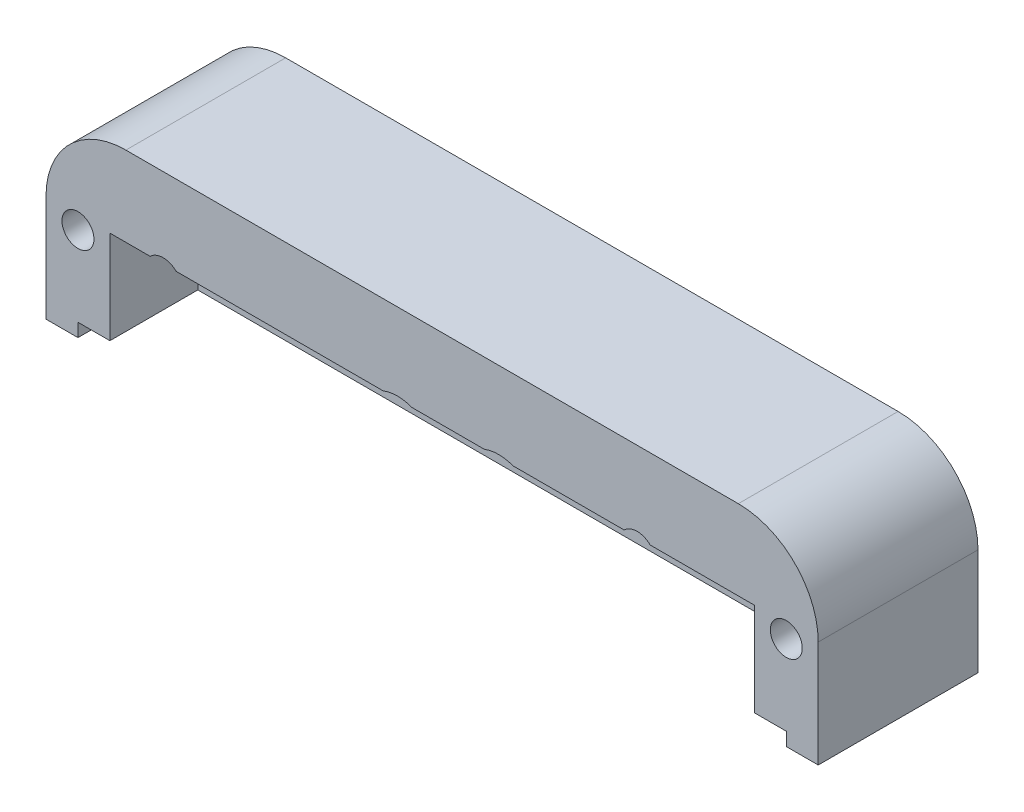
ISO-10303-21;
HEADER;
FILE_DESCRIPTION(('STEP AP214'),'2;1');
FILE_NAME('part.step','',(''),(''),'','','');
FILE_SCHEMA(('AUTOMOTIVE_DESIGN { 1 0 10303 214 1 1 1 1 }'));
ENDSEC;
DATA;
#1=APPLICATION_CONTEXT('core data for automotive mechanical design processes');
#2=APPLICATION_PROTOCOL_DEFINITION('international standard','automotive_design',2000,#1);
#3=PRODUCT_CONTEXT('',#1,'mechanical');
#4=PRODUCT('Part','Part','',(#3));
#5=PRODUCT_RELATED_PRODUCT_CATEGORY('part','',(#4));
#6=PRODUCT_DEFINITION_FORMATION('','',#4);
#7=PRODUCT_DEFINITION_CONTEXT('part definition',#1,'design');
#8=PRODUCT_DEFINITION('design','',#6,#7);
#9=PRODUCT_DEFINITION_SHAPE('','',#8);
#10=(LENGTH_UNIT() NAMED_UNIT(*) SI_UNIT(.MILLI.,.METRE.));
#11=(NAMED_UNIT(*) PLANE_ANGLE_UNIT() SI_UNIT($,.RADIAN.));
#12=(NAMED_UNIT(*) SI_UNIT($,.STERADIAN.) SOLID_ANGLE_UNIT());
#13=UNCERTAINTY_MEASURE_WITH_UNIT(LENGTH_MEASURE(1.E-05),#10,'distance_accuracy_value','');
#14=(GEOMETRIC_REPRESENTATION_CONTEXT(3) GLOBAL_UNCERTAINTY_ASSIGNED_CONTEXT((#13)) GLOBAL_UNIT_ASSIGNED_CONTEXT((#10,
#11,#12)) REPRESENTATION_CONTEXT('',''));
#15=CARTESIAN_POINT('',(0.,0.,0.));
#16=DIRECTION('',(0.,0.,1.));
#17=DIRECTION('',(1.,0.,0.));
#18=AXIS2_PLACEMENT_3D('',#15,#16,#17);
#19=CARTESIAN_POINT('',(-73.8083608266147,1.08156257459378,90.226974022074));
#20=DIRECTION('',(1.,0.,0.));
#21=DIRECTION('',(0.,1.,0.));
#22=AXIS2_PLACEMENT_3D('',#19,#20,#21);
#23=PLANE('',#22);
#24=DIRECTION('',(0.,-1.,0.));
#25=VECTOR('',#24,1.);
#26=CARTESIAN_POINT('',(-73.8083608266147,21.0815625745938,30.226974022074));
#27=LINE('',#26,#25);
#28=CARTESIAN_POINT('',(-73.8083608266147,21.0815625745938,30.226974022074));
#29=VERTEX_POINT('',#28);
#30=CARTESIAN_POINT('',(-73.8083608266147,1.08156257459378,30.226974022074));
#31=VERTEX_POINT('',#30);
#32=EDGE_CURVE('E207',#29,#31,#27,.T.);
#33=ORIENTED_EDGE('',*,*,#32,.F.);
#34=DIRECTION('',(0.,0.,-1.));
#35=VECTOR('',#34,1.);
#36=CARTESIAN_POINT('',(-73.8083608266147,21.0815625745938,90.226974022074));
#37=LINE('',#36,#35);
#38=CARTESIAN_POINT('',(-73.8083608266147,21.0815625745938,0.226974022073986));
#39=VERTEX_POINT('',#38);
#40=EDGE_CURVE('E219',#29,#39,#37,.T.);
#41=ORIENTED_EDGE('',*,*,#40,.T.);
#42=DIRECTION('',(0.,-1.,0.));
#43=VECTOR('',#42,1.);
#44=CARTESIAN_POINT('',(-73.8083608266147,1.08156257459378,0.226974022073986));
#45=LINE('',#44,#43);
#46=CARTESIAN_POINT('',(-73.8083608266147,1.08156257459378,0.226974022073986));
#47=VERTEX_POINT('',#46);
#48=EDGE_CURVE('E584',#39,#47,#45,.T.);
#49=ORIENTED_EDGE('',*,*,#48,.T.);
#50=DIRECTION('',(0.,0.,-1.));
#51=VECTOR('',#50,1.);
#52=CARTESIAN_POINT('',(-73.8083608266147,1.08156257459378,90.226974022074));
#53=LINE('',#52,#51);
#54=EDGE_CURVE('E221',#31,#47,#53,.T.);
#55=ORIENTED_EDGE('',*,*,#54,.F.);
#56=EDGE_LOOP('',(#33,#41,#49,#55));
#57=FACE_BOUND('',#56,.T.);
#58=ADVANCED_FACE('F38',(#57),#23,.F.);
#59=CARTESIAN_POINT('',(71.1916391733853,1.08156257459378,90.226974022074));
#60=DIRECTION('',(0.,1.,0.));
#61=DIRECTION('',(0.,0.,1.));
#62=AXIS2_PLACEMENT_3D('',#59,#60,#61);
#63=PLANE('',#62);
#64=DIRECTION('',(1.,0.,0.));
#65=VECTOR('',#64,1.);
#66=CARTESIAN_POINT('',(-73.8083608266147,1.08156257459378,30.226974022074));
#67=LINE('',#66,#65);
#68=CARTESIAN_POINT('',(-67.8083608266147,1.08156257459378,30.226974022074));
#69=VERTEX_POINT('',#68);
#70=EDGE_CURVE('E455',#31,#69,#67,.T.);
#71=ORIENTED_EDGE('',*,*,#70,.F.);
#72=ORIENTED_EDGE('',*,*,#54,.T.);
#73=DIRECTION('',(1.,0.,0.));
#74=VECTOR('',#73,1.);
#75=CARTESIAN_POINT('',(71.1916391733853,1.08156257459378,0.226974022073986));
#76=LINE('',#75,#74);
#77=CARTESIAN_POINT('',(71.1916391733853,1.08156257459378,0.226974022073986));
#78=VERTEX_POINT('',#77);
#79=EDGE_CURVE('E588',#47,#78,#76,.T.);
#80=ORIENTED_EDGE('',*,*,#79,.T.);
#81=DIRECTION('',(0.,0.,-1.));
#82=VECTOR('',#81,1.);
#83=CARTESIAN_POINT('',(71.1916391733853,1.08156257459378,90.226974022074));
#84=LINE('',#83,#82);
#85=CARTESIAN_POINT('',(71.1916391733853,1.08156257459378,30.226974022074));
#86=VERTEX_POINT('',#85);
#87=EDGE_CURVE('E239',#86,#78,#84,.T.);
#88=ORIENTED_EDGE('',*,*,#87,.F.);
#89=CARTESIAN_POINT('',(65.1916391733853,1.08156257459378,30.226974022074));
#90=VERTEX_POINT('',#89);
#91=EDGE_CURVE('E222',#90,#86,#67,.T.);
#92=ORIENTED_EDGE('',*,*,#91,.F.);
#93=DIRECTION('',(0.,0.,1.));
#94=VECTOR('',#93,1.);
#95=CARTESIAN_POINT('',(65.1916391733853,1.08156257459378,78.726974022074));
#96=LINE('',#95,#94);
#97=CARTESIAN_POINT('',(65.1916391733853,1.08156257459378,11.726974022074));
#98=VERTEX_POINT('',#97);
#99=EDGE_CURVE('E531',#98,#90,#96,.T.);
#100=ORIENTED_EDGE('',*,*,#99,.F.);
#101=CARTESIAN_POINT('',(62.1916391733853,1.08156257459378,11.726974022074));
#102=DIRECTION('',(0.,-1.,0.));
#103=DIRECTION('',(0.,0.,-1.));
#104=AXIS2_PLACEMENT_3D('',#101,#102,#103);
#105=CIRCLE('',#104,3.);
#106=CARTESIAN_POINT('',(62.1916391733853,1.08156257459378,8.72697402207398));
#107=VERTEX_POINT('',#106);
#108=EDGE_CURVE('E551',#107,#98,#105,.T.);
#109=ORIENTED_EDGE('',*,*,#108,.F.);
#110=DIRECTION('',(1.,0.,0.));
#111=VECTOR('',#110,1.);
#112=CARTESIAN_POINT('',(-64.8083608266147,1.08156257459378,8.72697402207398));
#113=LINE('',#112,#111);
#114=CARTESIAN_POINT('',(-64.8083608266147,1.08156257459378,8.72697402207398));
#115=VERTEX_POINT('',#114);
#116=EDGE_CURVE('E548',#115,#107,#113,.T.);
#117=ORIENTED_EDGE('',*,*,#116,.F.);
#118=CARTESIAN_POINT('',(-64.8083608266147,1.08156257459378,11.726974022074));
#119=DIRECTION('',(0.,-1.,0.));
#120=DIRECTION('',(0.,0.,-1.));
#121=AXIS2_PLACEMENT_3D('',#118,#119,#120);
#122=CIRCLE('',#121,3.);
#123=CARTESIAN_POINT('',(-67.8083608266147,1.08156257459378,11.726974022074));
#124=VERTEX_POINT('',#123);
#125=EDGE_CURVE('E545',#124,#115,#122,.T.);
#126=ORIENTED_EDGE('',*,*,#125,.F.);
#127=DIRECTION('',(0.,0.,-1.));
#128=VECTOR('',#127,1.);
#129=CARTESIAN_POINT('',(-67.8083608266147,1.08156257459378,78.726974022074));
#130=LINE('',#129,#128);
#131=EDGE_CURVE('E517',#69,#124,#130,.T.);
#132=ORIENTED_EDGE('',*,*,#131,.F.);
#133=EDGE_LOOP('',(#71,#72,#80,#88,#92,#100,#109,#117,#126,#132));
#134=FACE_BOUND('',#133,.T.);
#135=ADVANCED_FACE('F304',(#134),#63,.F.);
#136=CARTESIAN_POINT('',(71.1916391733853,21.0815625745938,90.226974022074));
#137=DIRECTION('',(-1.,0.,0.));
#138=DIRECTION('',(0.,-1.,0.));
#139=AXIS2_PLACEMENT_3D('',#136,#137,#138);
#140=PLANE('',#139);
#141=DIRECTION('',(0.,1.,0.));
#142=VECTOR('',#141,1.);
#143=CARTESIAN_POINT('',(71.1916391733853,1.08156257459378,30.226974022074));
#144=LINE('',#143,#142);
#145=CARTESIAN_POINT('',(71.1916391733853,21.0815625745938,30.226974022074));
#146=VERTEX_POINT('',#145);
#147=EDGE_CURVE('E457',#86,#146,#144,.T.);
#148=ORIENTED_EDGE('',*,*,#147,.F.);
#149=ORIENTED_EDGE('',*,*,#87,.T.);
#150=DIRECTION('',(0.,1.,0.));
#151=VECTOR('',#150,1.);
#152=CARTESIAN_POINT('',(71.1916391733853,21.0815625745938,0.226974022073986));
#153=LINE('',#152,#151);
#154=CARTESIAN_POINT('',(71.1916391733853,21.0815625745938,0.226974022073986));
#155=VERTEX_POINT('',#154);
#156=EDGE_CURVE('E591',#78,#155,#153,.T.);
#157=ORIENTED_EDGE('',*,*,#156,.T.);
#158=DIRECTION('',(0.,0.,-1.));
#159=VECTOR('',#158,1.);
#160=CARTESIAN_POINT('',(71.1916391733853,21.0815625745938,90.226974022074));
#161=LINE('',#160,#159);
#162=EDGE_CURVE('E237',#146,#155,#161,.T.);
#163=ORIENTED_EDGE('',*,*,#162,.F.);
#164=EDGE_LOOP('',(#148,#149,#157,#163));
#165=FACE_BOUND('',#164,.T.);
#166=ADVANCED_FACE('F310',(#165),#140,.F.);
#167=CARTESIAN_POINT('',(56.1916391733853,21.0815625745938,90.226974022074));
#168=DIRECTION('',(0.,0.,-1.));
#169=DIRECTION('',(-1.,0.,0.));
#170=AXIS2_PLACEMENT_3D('',#167,#168,#169);
#171=CYLINDRICAL_SURFACE('',#170,15.);
#172=CARTESIAN_POINT('',(56.1916391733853,21.0815625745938,30.226974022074));
#173=DIRECTION('',(0.,0.,1.));
#174=DIRECTION('',(1.,0.,0.));
#175=AXIS2_PLACEMENT_3D('',#172,#173,#174);
#176=CIRCLE('',#175,15.);
#177=CARTESIAN_POINT('',(56.1916391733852,36.0815625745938,30.226974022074));
#178=VERTEX_POINT('',#177);
#179=EDGE_CURVE('E459',#146,#178,#176,.T.);
#180=ORIENTED_EDGE('',*,*,#179,.F.);
#181=ORIENTED_EDGE('',*,*,#162,.T.);
#182=CARTESIAN_POINT('',(56.1916391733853,21.0815625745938,0.226974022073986));
#183=DIRECTION('',(0.,0.,1.));
#184=DIRECTION('',(-1.,0.,0.));
#185=AXIS2_PLACEMENT_3D('',#182,#183,#184);
#186=CIRCLE('',#185,15.);
#187=CARTESIAN_POINT('',(56.1916391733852,36.0815625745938,0.226974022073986));
#188=VERTEX_POINT('',#187);
#189=EDGE_CURVE('E594',#155,#188,#186,.T.);
#190=ORIENTED_EDGE('',*,*,#189,.T.);
#191=DIRECTION('',(0.,0.,-1.));
#192=VECTOR('',#191,1.);
#193=CARTESIAN_POINT('',(56.1916391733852,36.0815625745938,90.226974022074));
#194=LINE('',#193,#192);
#195=EDGE_CURVE('E230',#178,#188,#194,.T.);
#196=ORIENTED_EDGE('',*,*,#195,.F.);
#197=EDGE_LOOP('',(#180,#181,#190,#196));
#198=FACE_BOUND('',#197,.T.);
#199=ADVANCED_FACE('F316',(#198),#171,.T.);
#200=CARTESIAN_POINT('',(-58.8083608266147,36.0815625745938,90.226974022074));
#201=DIRECTION('',(0.,-1.,0.));
#202=DIRECTION('',(1.,0.,0.));
#203=AXIS2_PLACEMENT_3D('',#200,#201,#202);
#204=PLANE('',#203);
#205=DIRECTION('',(-1.,0.,0.));
#206=VECTOR('',#205,1.);
#207=CARTESIAN_POINT('',(56.1916391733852,36.0815625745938,30.226974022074));
#208=LINE('',#207,#206);
#209=CARTESIAN_POINT('',(-58.8083608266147,36.0815625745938,30.226974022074));
#210=VERTEX_POINT('',#209);
#211=EDGE_CURVE('E210',#178,#210,#208,.T.);
#212=ORIENTED_EDGE('',*,*,#211,.F.);
#213=ORIENTED_EDGE('',*,*,#195,.T.);
#214=DIRECTION('',(-1.,0.,0.));
#215=VECTOR('',#214,1.);
#216=CARTESIAN_POINT('',(-58.8083608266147,36.0815625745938,0.226974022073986));
#217=LINE('',#216,#215);
#218=CARTESIAN_POINT('',(-58.8083608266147,36.0815625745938,0.226974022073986));
#219=VERTEX_POINT('',#218);
#220=EDGE_CURVE('E232',#188,#219,#217,.T.);
#221=ORIENTED_EDGE('',*,*,#220,.T.);
#222=DIRECTION('',(0.,0.,-1.));
#223=VECTOR('',#222,1.);
#224=CARTESIAN_POINT('',(-58.8083608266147,36.0815625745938,90.226974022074));
#225=LINE('',#224,#223);
#226=EDGE_CURVE('E228',#210,#219,#225,.T.);
#227=ORIENTED_EDGE('',*,*,#226,.F.);
#228=EDGE_LOOP('',(#212,#213,#221,#227));
#229=FACE_BOUND('',#228,.T.);
#230=ADVANCED_FACE('F320',(#229),#204,.F.);
#231=CARTESIAN_POINT('',(-58.8083608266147,21.0815625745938,90.226974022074));
#232=DIRECTION('',(0.,0.,-1.));
#233=DIRECTION('',(-1.,0.,0.));
#234=AXIS2_PLACEMENT_3D('',#231,#232,#233);
#235=CYLINDRICAL_SURFACE('',#234,15.);
#236=CARTESIAN_POINT('',(-58.8083608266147,21.0815625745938,30.226974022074));
#237=DIRECTION('',(0.,0.,1.));
#238=DIRECTION('',(1.,0.,0.));
#239=AXIS2_PLACEMENT_3D('',#236,#237,#238);
#240=CIRCLE('',#239,15.);
#241=EDGE_CURVE('E204',#210,#29,#240,.T.);
#242=ORIENTED_EDGE('',*,*,#241,.F.);
#243=ORIENTED_EDGE('',*,*,#226,.T.);
#244=CARTESIAN_POINT('',(-58.8083608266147,21.0815625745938,0.226974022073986));
#245=DIRECTION('',(0.,0.,1.));
#246=DIRECTION('',(-1.,0.,0.));
#247=AXIS2_PLACEMENT_3D('',#244,#245,#246);
#248=CIRCLE('',#247,15.);
#249=EDGE_CURVE('E226',#219,#39,#248,.T.);
#250=ORIENTED_EDGE('',*,*,#249,.T.);
#251=ORIENTED_EDGE('',*,*,#40,.F.);
#252=EDGE_LOOP('',(#242,#243,#250,#251));
#253=FACE_BOUND('',#252,.T.);
#254=ADVANCED_FACE('F224',(#253),#235,.T.);
#255=CARTESIAN_POINT('',(62.1916391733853,3.58156257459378,78.726974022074));
#256=DIRECTION('',(0.,1.,0.));
#257=DIRECTION('',(0.,0.,1.));
#258=AXIS2_PLACEMENT_3D('',#255,#256,#257);
#259=PLANE('',#258);
#260=CARTESIAN_POINT('',(61.1916391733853,3.58156257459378,12.726974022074));
#261=DIRECTION('',(0.,-1.,0.));
#262=DIRECTION('',(0.,0.,-1.));
#263=AXIS2_PLACEMENT_3D('',#260,#261,#262);
#264=CIRCLE('',#263,2.);
#265=CARTESIAN_POINT('',(61.1916391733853,3.58156257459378,10.726974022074));
#266=VERTEX_POINT('',#265);
#267=EDGE_CURVE('E518',#266,#266,#264,.T.);
#268=ORIENTED_EDGE('',*,*,#267,.F.);
#269=EDGE_LOOP('',(#268));
#270=FACE_BOUND('',#269,.T.);
#271=CARTESIAN_POINT('',(-63.8083608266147,3.58156257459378,12.726974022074));
#272=DIRECTION('',(0.,-1.,0.));
#273=DIRECTION('',(0.,0.,-1.));
#274=AXIS2_PLACEMENT_3D('',#271,#272,#273);
#275=CIRCLE('',#274,2.);
#276=CARTESIAN_POINT('',(-63.8083608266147,3.58156257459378,10.726974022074));
#277=VERTEX_POINT('',#276);
#278=EDGE_CURVE('E513',#277,#277,#275,.T.);
#279=ORIENTED_EDGE('',*,*,#278,.F.);
#280=EDGE_LOOP('',(#279));
#281=FACE_BOUND('',#280,.T.);
#282=DIRECTION('',(1.,0.,0.));
#283=VECTOR('',#282,1.);
#284=CARTESIAN_POINT('',(62.1916391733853,3.58156257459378,30.226974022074));
#285=LINE('',#284,#283);
#286=CARTESIAN_POINT('',(-67.8083608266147,3.58156257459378,30.226974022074));
#287=VERTEX_POINT('',#286);
#288=CARTESIAN_POINT('',(-61.8083608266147,3.58156257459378,30.226974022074));
#289=VERTEX_POINT('',#288);
#290=EDGE_CURVE('E471',#287,#289,#285,.T.);
#291=ORIENTED_EDGE('',*,*,#290,.F.);
#292=DIRECTION('',(0.,0.,-1.));
#293=VECTOR('',#292,1.);
#294=CARTESIAN_POINT('',(-67.8083608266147,3.58156257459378,78.726974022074));
#295=LINE('',#294,#293);
#296=CARTESIAN_POINT('',(-67.8083608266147,3.58156257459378,11.726974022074));
#297=VERTEX_POINT('',#296);
#298=EDGE_CURVE('E528',#287,#297,#295,.T.);
#299=ORIENTED_EDGE('',*,*,#298,.T.);
#300=CARTESIAN_POINT('',(-64.8083608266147,3.58156257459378,11.726974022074));
#301=DIRECTION('',(0.,-1.,0.));
#302=DIRECTION('',(0.,0.,-1.));
#303=AXIS2_PLACEMENT_3D('',#300,#301,#302);
#304=CIRCLE('',#303,3.);
#305=CARTESIAN_POINT('',(-64.8083608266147,3.58156257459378,8.72697402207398));
#306=VERTEX_POINT('',#305);
#307=EDGE_CURVE('E530',#297,#306,#304,.T.);
#308=ORIENTED_EDGE('',*,*,#307,.T.);
#309=DIRECTION('',(1.,0.,0.));
#310=VECTOR('',#309,1.);
#311=CARTESIAN_POINT('',(-64.8083608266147,3.58156257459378,8.72697402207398));
#312=LINE('',#311,#310);
#313=CARTESIAN_POINT('',(62.1916391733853,3.58156257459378,8.72697402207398));
#314=VERTEX_POINT('',#313);
#315=EDGE_CURVE('E534',#306,#314,#312,.T.);
#316=ORIENTED_EDGE('',*,*,#315,.T.);
#317=CARTESIAN_POINT('',(62.1916391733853,3.58156257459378,11.726974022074));
#318=DIRECTION('',(0.,-1.,0.));
#319=DIRECTION('',(0.,0.,-1.));
#320=AXIS2_PLACEMENT_3D('',#317,#318,#319);
#321=CIRCLE('',#320,3.);
#322=CARTESIAN_POINT('',(65.1916391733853,3.58156257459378,11.726974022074));
#323=VERTEX_POINT('',#322);
#324=EDGE_CURVE('E537',#314,#323,#321,.T.);
#325=ORIENTED_EDGE('',*,*,#324,.T.);
#326=DIRECTION('',(0.,0.,1.));
#327=VECTOR('',#326,1.);
#328=CARTESIAN_POINT('',(65.1916391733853,3.58156257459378,78.726974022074));
#329=LINE('',#328,#327);
#330=CARTESIAN_POINT('',(65.1916391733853,3.58156257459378,30.226974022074));
#331=VERTEX_POINT('',#330);
#332=EDGE_CURVE('E540',#323,#331,#329,.T.);
#333=ORIENTED_EDGE('',*,*,#332,.T.);
#334=CARTESIAN_POINT('',(59.1916391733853,3.58156257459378,30.226974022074));
#335=VERTEX_POINT('',#334);
#336=EDGE_CURVE('E473',#335,#331,#285,.T.);
#337=ORIENTED_EDGE('',*,*,#336,.F.);
#338=DIRECTION('',(0.,0.,1.));
#339=VECTOR('',#338,1.);
#340=CARTESIAN_POINT('',(59.1916391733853,3.58156257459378,76.726974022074));
#341=LINE('',#340,#339);
#342=CARTESIAN_POINT('',(59.1916391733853,3.58156257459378,13.726974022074));
#343=VERTEX_POINT('',#342);
#344=EDGE_CURVE('E242',#343,#335,#341,.T.);
#345=ORIENTED_EDGE('',*,*,#344,.F.);
#346=DIRECTION('',(1.,0.,0.));
#347=VECTOR('',#346,1.);
#348=CARTESIAN_POINT('',(-61.8083608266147,3.58156257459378,13.726974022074));
#349=LINE('',#348,#347);
#350=CARTESIAN_POINT('',(-61.8083608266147,3.58156257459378,13.726974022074));
#351=VERTEX_POINT('',#350);
#352=EDGE_CURVE('E566',#351,#343,#349,.T.);
#353=ORIENTED_EDGE('',*,*,#352,.F.);
#354=DIRECTION('',(0.,0.,-1.));
#355=VECTOR('',#354,1.);
#356=CARTESIAN_POINT('',(-61.8083608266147,3.58156257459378,76.726974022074));
#357=LINE('',#356,#355);
#358=EDGE_CURVE('E558',#289,#351,#357,.T.);
#359=ORIENTED_EDGE('',*,*,#358,.F.);
#360=EDGE_LOOP('',(#291,#299,#308,#316,#325,#333,#337,#345,#353,#359));
#361=FACE_BOUND('',#360,.T.);
#362=ADVANCED_FACE('F327',(#270,#281,#361),#259,.F.);
#363=CARTESIAN_POINT('',(65.1916391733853,3.58156257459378,78.726974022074));
#364=DIRECTION('',(1.,0.,0.));
#365=DIRECTION('',(0.,0.,-1.));
#366=AXIS2_PLACEMENT_3D('',#363,#364,#365);
#367=PLANE('',#366);
#368=DIRECTION('',(0.,-1.,0.));
#369=VECTOR('',#368,1.);
#370=CARTESIAN_POINT('',(65.1916391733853,3.58156257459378,30.226974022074));
#371=LINE('',#370,#369);
#372=EDGE_CURVE('E478',#331,#90,#371,.T.);
#373=ORIENTED_EDGE('',*,*,#372,.F.);
#374=ORIENTED_EDGE('',*,*,#332,.F.);
#375=DIRECTION('',(0.,-1.,0.));
#376=VECTOR('',#375,1.);
#377=CARTESIAN_POINT('',(65.1916391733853,3.58156257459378,11.726974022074));
#378=LINE('',#377,#376);
#379=EDGE_CURVE('E556',#323,#98,#378,.T.);
#380=ORIENTED_EDGE('',*,*,#379,.T.);
#381=ORIENTED_EDGE('',*,*,#99,.T.);
#382=EDGE_LOOP('',(#373,#374,#380,#381));
#383=FACE_BOUND('',#382,.T.);
#384=ADVANCED_FACE('F358',(#383),#367,.F.);
#385=CARTESIAN_POINT('',(-67.8083608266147,3.58156257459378,78.726974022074));
#386=DIRECTION('',(-1.,0.,0.));
#387=DIRECTION('',(0.,0.,1.));
#388=AXIS2_PLACEMENT_3D('',#385,#386,#387);
#389=PLANE('',#388);
#390=DIRECTION('',(0.,1.,0.));
#391=VECTOR('',#390,1.);
#392=CARTESIAN_POINT('',(-67.8083608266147,3.58156257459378,30.226974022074));
#393=LINE('',#392,#391);
#394=EDGE_CURVE('E474',#69,#287,#393,.T.);
#395=ORIENTED_EDGE('',*,*,#394,.F.);
#396=ORIENTED_EDGE('',*,*,#131,.T.);
#397=DIRECTION('',(0.,-1.,0.));
#398=VECTOR('',#397,1.);
#399=CARTESIAN_POINT('',(-67.8083608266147,3.58156257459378,11.726974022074));
#400=LINE('',#399,#398);
#401=EDGE_CURVE('E543',#297,#124,#400,.T.);
#402=ORIENTED_EDGE('',*,*,#401,.F.);
#403=ORIENTED_EDGE('',*,*,#298,.F.);
#404=EDGE_LOOP('',(#395,#396,#402,#403));
#405=FACE_BOUND('',#404,.T.);
#406=ADVANCED_FACE('F354',(#405),#389,.F.);
#407=CARTESIAN_POINT('',(-1.30836082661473,21.0815625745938,0.226974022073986));
#408=DIRECTION('',(0.,1.,0.));
#409=DIRECTION('',(0.,0.,1.));
#410=AXIS2_PLACEMENT_3D('',#407,#408,#409);
#411=PLANE('',#410);
#412=DIRECTION('',(1.,0.,0.));
#413=VECTOR('',#412,1.);
#414=CARTESIAN_POINT('',(-1.30836082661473,21.0815625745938,30.226974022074));
#415=LINE('',#414,#413);
#416=CARTESIAN_POINT('',(-61.8083608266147,21.0815625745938,30.226974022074));
#417=VERTEX_POINT('',#416);
#418=CARTESIAN_POINT('',(-54.2578505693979,21.0815625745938,30.226974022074));
#419=VERTEX_POINT('',#418);
#420=EDGE_CURVE('E468',#417,#419,#415,.T.);
#421=ORIENTED_EDGE('',*,*,#420,.F.);
#422=DIRECTION('',(0.,0.,-1.));
#423=VECTOR('',#422,1.);
#424=CARTESIAN_POINT('',(-61.8083608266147,21.0815625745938,76.726974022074));
#425=LINE('',#424,#423);
#426=CARTESIAN_POINT('',(-61.8083608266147,21.0815625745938,13.726974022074));
#427=VERTEX_POINT('',#426);
#428=EDGE_CURVE('E578',#417,#427,#425,.T.);
#429=ORIENTED_EDGE('',*,*,#428,.T.);
#430=DIRECTION('',(1.,0.,0.));
#431=VECTOR('',#430,1.);
#432=CARTESIAN_POINT('',(-61.8083608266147,21.0815625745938,13.726974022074));
#433=LINE('',#432,#431);
#434=CARTESIAN_POINT('',(-54.2578505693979,21.0815625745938,13.726974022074));
#435=VERTEX_POINT('',#434);
#436=EDGE_CURVE('E570',#427,#435,#433,.T.);
#437=ORIENTED_EDGE('',*,*,#436,.T.);
#438=DIRECTION('',(0.,0.,-1.));
#439=VECTOR('',#438,1.);
#440=CARTESIAN_POINT('',(-54.2578505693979,21.0815625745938,30.226974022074));
#441=LINE('',#440,#439);
#442=EDGE_CURVE('E252',#435,#419,#441,.F.);
#443=ORIENTED_EDGE('',*,*,#442,.T.);
#444=EDGE_LOOP('',(#421,#429,#437,#443));
#445=FACE_BOUND('',#444,.T.);
#446=ADVANCED_FACE('F350',(#445),#411,.F.);
#447=CARTESIAN_POINT('',(-49.3588710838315,21.0815625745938,30.226974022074));
#448=VERTEX_POINT('',#447);
#449=CARTESIAN_POINT('',(-10.500943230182,21.0815625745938,30.226974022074));
#450=VERTEX_POINT('',#449);
#451=EDGE_CURVE('E52',#448,#450,#415,.T.);
#452=ORIENTED_EDGE('',*,*,#451,.F.);
#453=DIRECTION('',(0.,0.,-1.));
#454=VECTOR('',#453,1.);
#455=CARTESIAN_POINT('',(-49.3588710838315,21.0815625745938,30.226974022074));
#456=LINE('',#455,#454);
#457=CARTESIAN_POINT('',(-49.3588710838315,21.0815625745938,13.726974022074));
#458=VERTEX_POINT('',#457);
#459=EDGE_CURVE('E502',#448,#458,#456,.T.);
#460=ORIENTED_EDGE('',*,*,#459,.T.);
#461=CARTESIAN_POINT('',(-10.500943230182,21.0815625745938,13.726974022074));
#462=VERTEX_POINT('',#461);
#463=EDGE_CURVE('E574',#458,#462,#433,.T.);
#464=ORIENTED_EDGE('',*,*,#463,.T.);
#465=DIRECTION('',(0.,0.,-1.));
#466=VECTOR('',#465,1.);
#467=CARTESIAN_POINT('',(-10.500943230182,21.0815625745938,33.726974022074));
#468=LINE('',#467,#466);
#469=EDGE_CURVE('E486',#462,#450,#468,.F.);
#470=ORIENTED_EDGE('',*,*,#469,.T.);
#471=EDGE_LOOP('',(#452,#460,#464,#470));
#472=FACE_BOUND('',#471,.T.);
#473=ADVANCED_FACE('F353',(#472),#411,.F.);
#474=CARTESIAN_POINT('',(-5.11577842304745,21.0815625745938,30.226974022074));
#475=VERTEX_POINT('',#474);
#476=CARTESIAN_POINT('',(8.499056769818,21.0815625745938,30.226974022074));
#477=VERTEX_POINT('',#476);
#478=EDGE_CURVE('E462',#475,#477,#415,.T.);
#479=ORIENTED_EDGE('',*,*,#478,.F.);
#480=DIRECTION('',(0.,0.,-1.));
#481=VECTOR('',#480,1.);
#482=CARTESIAN_POINT('',(-5.11577842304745,21.0815625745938,33.726974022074));
#483=LINE('',#482,#481);
#484=CARTESIAN_POINT('',(-5.11577842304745,21.0815625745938,13.726974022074));
#485=VERTEX_POINT('',#484);
#486=EDGE_CURVE('E489',#475,#485,#483,.T.);
#487=ORIENTED_EDGE('',*,*,#486,.T.);
#488=CARTESIAN_POINT('',(8.499056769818,21.0815625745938,13.726974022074));
#489=VERTEX_POINT('',#488);
#490=EDGE_CURVE('E654',#485,#489,#433,.T.);
#491=ORIENTED_EDGE('',*,*,#490,.T.);
#492=DIRECTION('',(0.,0.,-1.));
#493=VECTOR('',#492,1.);
#494=CARTESIAN_POINT('',(8.499056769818,21.0815625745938,33.726974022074));
#495=LINE('',#494,#493);
#496=EDGE_CURVE('E60',#489,#477,#495,.F.);
#497=ORIENTED_EDGE('',*,*,#496,.T.);
#498=EDGE_LOOP('',(#479,#487,#491,#497));
#499=FACE_BOUND('',#498,.T.);
#500=ADVANCED_FACE('F671',(#499),#411,.F.);
#501=CARTESIAN_POINT('',(13.8842215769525,21.0815625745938,30.226974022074));
#502=VERTEX_POINT('',#501);
#503=CARTESIAN_POINT('',(34.7421494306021,21.0815625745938,30.226974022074));
#504=VERTEX_POINT('',#503);
#505=EDGE_CURVE('E470',#502,#504,#415,.T.);
#506=ORIENTED_EDGE('',*,*,#505,.F.);
#507=DIRECTION('',(0.,0.,-1.));
#508=VECTOR('',#507,1.);
#509=CARTESIAN_POINT('',(13.8842215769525,21.0815625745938,33.726974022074));
#510=LINE('',#509,#508);
#511=CARTESIAN_POINT('',(13.8842215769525,21.0815625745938,13.726974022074));
#512=VERTEX_POINT('',#511);
#513=EDGE_CURVE('E283',#502,#512,#510,.T.);
#514=ORIENTED_EDGE('',*,*,#513,.T.);
#515=CARTESIAN_POINT('',(34.7421494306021,21.0815625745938,13.726974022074));
#516=VERTEX_POINT('',#515);
#517=EDGE_CURVE('E575',#512,#516,#433,.T.);
#518=ORIENTED_EDGE('',*,*,#517,.T.);
#519=DIRECTION('',(0.,0.,-1.));
#520=VECTOR('',#519,1.);
#521=CARTESIAN_POINT('',(34.7421494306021,21.0815625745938,30.226974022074));
#522=LINE('',#521,#520);
#523=EDGE_CURVE('E507',#516,#504,#522,.F.);
#524=ORIENTED_EDGE('',*,*,#523,.T.);
#525=EDGE_LOOP('',(#506,#514,#518,#524));
#526=FACE_BOUND('',#525,.T.);
#527=ADVANCED_FACE('F674',(#526),#411,.F.);
#528=CARTESIAN_POINT('',(39.6411289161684,21.0815625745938,30.226974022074));
#529=VERTEX_POINT('',#528);
#530=CARTESIAN_POINT('',(59.1916391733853,21.0815625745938,30.226974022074));
#531=VERTEX_POINT('',#530);
#532=EDGE_CURVE('E464',#529,#531,#415,.T.);
#533=ORIENTED_EDGE('',*,*,#532,.F.);
#534=DIRECTION('',(0.,0.,-1.));
#535=VECTOR('',#534,1.);
#536=CARTESIAN_POINT('',(39.6411289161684,21.0815625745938,30.226974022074));
#537=LINE('',#536,#535);
#538=CARTESIAN_POINT('',(39.6411289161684,21.0815625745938,13.726974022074));
#539=VERTEX_POINT('',#538);
#540=EDGE_CURVE('E510',#529,#539,#537,.T.);
#541=ORIENTED_EDGE('',*,*,#540,.T.);
#542=CARTESIAN_POINT('',(59.1916391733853,21.0815625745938,13.726974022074));
#543=VERTEX_POINT('',#542);
#544=EDGE_CURVE('E569',#539,#543,#433,.T.);
#545=ORIENTED_EDGE('',*,*,#544,.T.);
#546=DIRECTION('',(0.,0.,1.));
#547=VECTOR('',#546,1.);
#548=CARTESIAN_POINT('',(59.1916391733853,21.0815625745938,76.726974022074));
#549=LINE('',#548,#547);
#550=EDGE_CURVE('E573',#543,#531,#549,.T.);
#551=ORIENTED_EDGE('',*,*,#550,.T.);
#552=EDGE_LOOP('',(#533,#541,#545,#551));
#553=FACE_BOUND('',#552,.T.);
#554=ADVANCED_FACE('F344',(#553),#411,.F.);
#555=CARTESIAN_POINT('',(59.1916391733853,21.0815625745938,76.726974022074));
#556=DIRECTION('',(1.,0.,0.));
#557=DIRECTION('',(0.,0.,-1.));
#558=AXIS2_PLACEMENT_3D('',#555,#556,#557);
#559=PLANE('',#558);
#560=DIRECTION('',(0.,-1.,0.));
#561=VECTOR('',#560,1.);
#562=CARTESIAN_POINT('',(59.1916391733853,21.0815625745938,30.226974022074));
#563=LINE('',#562,#561);
#564=EDGE_CURVE('E476',#531,#335,#563,.T.);
#565=ORIENTED_EDGE('',*,*,#564,.F.);
#566=ORIENTED_EDGE('',*,*,#550,.F.);
#567=DIRECTION('',(0.,-1.,0.));
#568=VECTOR('',#567,1.);
#569=CARTESIAN_POINT('',(59.1916391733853,21.0815625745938,13.726974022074));
#570=LINE('',#569,#568);
#571=EDGE_CURVE('E580',#543,#343,#570,.T.);
#572=ORIENTED_EDGE('',*,*,#571,.T.);
#573=ORIENTED_EDGE('',*,*,#344,.T.);
#574=EDGE_LOOP('',(#565,#566,#572,#573));
#575=FACE_BOUND('',#574,.T.);
#576=ADVANCED_FACE('F340',(#575),#559,.F.);
#577=CARTESIAN_POINT('',(-61.8083608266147,21.0815625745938,76.726974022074));
#578=DIRECTION('',(-1.,0.,0.));
#579=DIRECTION('',(0.,0.,1.));
#580=AXIS2_PLACEMENT_3D('',#577,#578,#579);
#581=PLANE('',#580);
#582=DIRECTION('',(0.,1.,0.));
#583=VECTOR('',#582,1.);
#584=CARTESIAN_POINT('',(-61.8083608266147,21.0815625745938,30.226974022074));
#585=LINE('',#584,#583);
#586=EDGE_CURVE('E467',#289,#417,#585,.T.);
#587=ORIENTED_EDGE('',*,*,#586,.F.);
#588=ORIENTED_EDGE('',*,*,#358,.T.);
#589=DIRECTION('',(0.,-1.,0.));
#590=VECTOR('',#589,1.);
#591=CARTESIAN_POINT('',(-61.8083608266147,21.0815625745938,13.726974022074));
#592=LINE('',#591,#590);
#593=EDGE_CURVE('E581',#427,#351,#592,.T.);
#594=ORIENTED_EDGE('',*,*,#593,.F.);
#595=ORIENTED_EDGE('',*,*,#428,.F.);
#596=EDGE_LOOP('',(#587,#588,#594,#595));
#597=FACE_BOUND('',#596,.T.);
#598=ADVANCED_FACE('F343',(#597),#581,.F.);
#599=CARTESIAN_POINT('',(11.1916391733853,14.0815625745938,33.726974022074));
#600=DIRECTION('',(0.,0.,-1.));
#601=DIRECTION('',(-1.,0.,0.));
#602=AXIS2_PLACEMENT_3D('',#599,#600,#601);
#603=CYLINDRICAL_SURFACE('',#602,7.5);
#604=CARTESIAN_POINT('',(11.1916391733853,14.0815625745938,8.72697402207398));
#605=DIRECTION('',(0.,0.,-1.));
#606=DIRECTION('',(-1.,0.,0.));
#607=AXIS2_PLACEMENT_3D('',#604,#605,#606);
#608=CIRCLE('',#607,7.5);
#609=CARTESIAN_POINT('',(3.69163917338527,14.0815625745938,8.72697402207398));
#610=VERTEX_POINT('',#609);
#611=EDGE_CURVE('E481',#610,#610,#608,.T.);
#612=ORIENTED_EDGE('',*,*,#611,.T.);
#613=EDGE_LOOP('',(#612));
#614=FACE_BOUND('',#613,.T.);
#615=CARTESIAN_POINT('',(11.1916391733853,14.0815625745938,30.226974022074));
#616=DIRECTION('',(0.,0.,1.));
#617=DIRECTION('',(1.,0.,0.));
#618=AXIS2_PLACEMENT_3D('',#615,#616,#617);
#619=CIRCLE('',#618,7.5);
#620=EDGE_CURVE('E465',#477,#502,#619,.F.);
#621=ORIENTED_EDGE('',*,*,#620,.F.);
#622=ORIENTED_EDGE('',*,*,#496,.F.);
#623=CARTESIAN_POINT('',(11.1916391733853,14.0815625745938,13.726974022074));
#624=DIRECTION('',(0.,0.,-1.));
#625=DIRECTION('',(-1.,0.,0.));
#626=AXIS2_PLACEMENT_3D('',#623,#624,#625);
#627=CIRCLE('',#626,7.5);
#628=EDGE_CURVE('E46',#512,#489,#627,.T.);
#629=ORIENTED_EDGE('',*,*,#628,.F.);
#630=ORIENTED_EDGE('',*,*,#513,.F.);
#631=EDGE_LOOP('',(#621,#622,#629,#630));
#632=FACE_BOUND('',#631,.T.);
#633=ADVANCED_FACE('F348',(#614,#632),#603,.F.);
#634=CARTESIAN_POINT('',(-7.80836082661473,14.0815625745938,33.726974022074));
#635=DIRECTION('',(0.,0.,-1.));
#636=DIRECTION('',(-1.,0.,0.));
#637=AXIS2_PLACEMENT_3D('',#634,#635,#636);
#638=CYLINDRICAL_SURFACE('',#637,7.5);
#639=CARTESIAN_POINT('',(-7.80836082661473,14.0815625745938,8.72697402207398));
#640=DIRECTION('',(0.,0.,-1.));
#641=DIRECTION('',(-1.,0.,0.));
#642=AXIS2_PLACEMENT_3D('',#639,#640,#641);
#643=CIRCLE('',#642,7.5);
#644=CARTESIAN_POINT('',(-15.3083608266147,14.0815625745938,8.72697402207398));
#645=VERTEX_POINT('',#644);
#646=EDGE_CURVE('E480',#645,#645,#643,.T.);
#647=ORIENTED_EDGE('',*,*,#646,.T.);
#648=EDGE_LOOP('',(#647));
#649=FACE_BOUND('',#648,.T.);
#650=CARTESIAN_POINT('',(-7.80836082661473,14.0815625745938,30.226974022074));
#651=DIRECTION('',(0.,0.,1.));
#652=DIRECTION('',(1.,0.,0.));
#653=AXIS2_PLACEMENT_3D('',#650,#651,#652);
#654=CIRCLE('',#653,7.5);
#655=EDGE_CURVE('E11',#450,#475,#654,.F.);
#656=ORIENTED_EDGE('',*,*,#655,.F.);
#657=ORIENTED_EDGE('',*,*,#469,.F.);
#658=CARTESIAN_POINT('',(-7.80836082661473,14.0815625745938,13.726974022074));
#659=DIRECTION('',(0.,0.,-1.));
#660=DIRECTION('',(-1.,0.,0.));
#661=AXIS2_PLACEMENT_3D('',#658,#659,#660);
#662=CIRCLE('',#661,7.5);
#663=EDGE_CURVE('E273',#485,#462,#662,.T.);
#664=ORIENTED_EDGE('',*,*,#663,.F.);
#665=ORIENTED_EDGE('',*,*,#486,.F.);
#666=EDGE_LOOP('',(#656,#657,#664,#665));
#667=FACE_BOUND('',#666,.T.);
#668=ADVANCED_FACE('F332',(#649,#667),#638,.F.);
#669=CARTESIAN_POINT('',(-58.8083608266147,21.0815625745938,0.226974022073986));
#670=DIRECTION('',(0.,0.,-1.));
#671=DIRECTION('',(-1.,0.,0.));
#672=AXIS2_PLACEMENT_3D('',#669,#670,#671);
#673=PLANE('',#672);
#674=CARTESIAN_POINT('',(-51.8083608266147,18.5815625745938,0.226974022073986));
#675=DIRECTION('',(0.,0.,-1.));
#676=DIRECTION('',(-1.,0.,0.));
#677=AXIS2_PLACEMENT_3D('',#674,#675,#676);
#678=CIRCLE('',#677,6.5);
#679=CARTESIAN_POINT('',(-47.1179450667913,14.0815625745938,0.226974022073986));
#680=VERTEX_POINT('',#679);
#681=CARTESIAN_POINT('',(-56.4987765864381,14.0815625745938,0.226974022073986));
#682=VERTEX_POINT('',#681);
#683=EDGE_CURVE('E262',#680,#682,#678,.F.);
#684=ORIENTED_EDGE('',*,*,#683,.T.);
#685=CARTESIAN_POINT('',(-51.8083608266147,9.5815625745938,0.226974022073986));
#686=DIRECTION('',(0.,0.,-1.));
#687=DIRECTION('',(-1.,0.,0.));
#688=AXIS2_PLACEMENT_3D('',#685,#686,#687);
#689=CIRCLE('',#688,6.5);
#690=EDGE_CURVE('E264',#682,#680,#689,.F.);
#691=ORIENTED_EDGE('',*,*,#690,.T.);
#692=EDGE_LOOP('',(#684,#691));
#693=FACE_BOUND('',#692,.T.);
#694=CARTESIAN_POINT('',(37.1916391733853,18.5815625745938,0.226974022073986));
#695=DIRECTION('',(0.,0.,-1.));
#696=DIRECTION('',(-1.,0.,0.));
#697=AXIS2_PLACEMENT_3D('',#694,#695,#696);
#698=CIRCLE('',#697,6.5);
#699=CARTESIAN_POINT('',(30.6916391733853,18.5815625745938,0.226974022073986));
#700=VERTEX_POINT('',#699);
#701=EDGE_CURVE('E259',#700,#700,#698,.F.);
#702=ORIENTED_EDGE('',*,*,#701,.T.);
#703=EDGE_LOOP('',(#702));
#704=FACE_BOUND('',#703,.T.);
#705=CARTESIAN_POINT('',(11.1916391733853,14.0815625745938,0.226974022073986));
#706=DIRECTION('',(0.,0.,-1.));
#707=DIRECTION('',(-1.,0.,0.));
#708=AXIS2_PLACEMENT_3D('',#705,#706,#707);
#709=CIRCLE('',#708,4.);
#710=CARTESIAN_POINT('',(7.19163917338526,14.0815625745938,0.226974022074));
#711=VERTEX_POINT('',#710);
#712=EDGE_CURVE('E494',#711,#711,#709,.T.);
#713=ORIENTED_EDGE('',*,*,#712,.F.);
#714=EDGE_LOOP('',(#713));
#715=FACE_BOUND('',#714,.T.);
#716=CARTESIAN_POINT('',(-7.80836082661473,14.0815625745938,0.226974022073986));
#717=DIRECTION('',(0.,0.,-1.));
#718=DIRECTION('',(-1.,0.,0.));
#719=AXIS2_PLACEMENT_3D('',#716,#717,#718);
#720=CIRCLE('',#719,4.);
#721=CARTESIAN_POINT('',(-11.8083608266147,14.0815625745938,0.226974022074));
#722=VERTEX_POINT('',#721);
#723=EDGE_CURVE('E282',#722,#722,#720,.T.);
#724=ORIENTED_EDGE('',*,*,#723,.F.);
#725=EDGE_LOOP('',(#724));
#726=FACE_BOUND('',#725,.T.);
#727=ORIENTED_EDGE('',*,*,#48,.F.);
#728=ORIENTED_EDGE('',*,*,#249,.F.);
#729=ORIENTED_EDGE('',*,*,#220,.F.);
#730=ORIENTED_EDGE('',*,*,#189,.F.);
#731=ORIENTED_EDGE('',*,*,#156,.F.);
#732=ORIENTED_EDGE('',*,*,#79,.F.);
#733=EDGE_LOOP('',(#727,#728,#729,#730,#731,#732));
#734=FACE_BOUND('',#733,.T.);
#735=ADVANCED_FACE('F328',(#693,#704,#715,#726,#734),#673,.T.);
#736=CARTESIAN_POINT('',(62.1916391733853,3.58156257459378,11.726974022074));
#737=DIRECTION('',(0.,-1.,0.));
#738=DIRECTION('',(0.,0.,-1.));
#739=AXIS2_PLACEMENT_3D('',#736,#737,#738);
#740=CYLINDRICAL_SURFACE('',#739,3.);
#741=ORIENTED_EDGE('',*,*,#108,.T.);
#742=ORIENTED_EDGE('',*,*,#379,.F.);
#743=ORIENTED_EDGE('',*,*,#324,.F.);
#744=DIRECTION('',(0.,-1.,0.));
#745=VECTOR('',#744,1.);
#746=CARTESIAN_POINT('',(62.1916391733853,3.58156257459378,8.72697402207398));
#747=LINE('',#746,#745);
#748=EDGE_CURVE('E559',#314,#107,#747,.T.);
#749=ORIENTED_EDGE('',*,*,#748,.T.);
#750=EDGE_LOOP('',(#741,#742,#743,#749));
#751=FACE_BOUND('',#750,.T.);
#752=ADVANCED_FACE('F331',(#751),#740,.F.);
#753=CARTESIAN_POINT('',(-64.8083608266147,3.58156257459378,8.72697402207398));
#754=DIRECTION('',(0.,0.,-1.));
#755=DIRECTION('',(-1.,0.,0.));
#756=AXIS2_PLACEMENT_3D('',#753,#754,#755);
#757=PLANE('',#756);
#758=ORIENTED_EDGE('',*,*,#116,.T.);
#759=ORIENTED_EDGE('',*,*,#748,.F.);
#760=ORIENTED_EDGE('',*,*,#315,.F.);
#761=DIRECTION('',(0.,-1.,0.));
#762=VECTOR('',#761,1.);
#763=CARTESIAN_POINT('',(-64.8083608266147,3.58156257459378,8.72697402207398));
#764=LINE('',#763,#762);
#765=EDGE_CURVE('E561',#306,#115,#764,.T.);
#766=ORIENTED_EDGE('',*,*,#765,.T.);
#767=EDGE_LOOP('',(#758,#759,#760,#766));
#768=FACE_BOUND('',#767,.T.);
#769=ADVANCED_FACE('F362',(#768),#757,.F.);
#770=CARTESIAN_POINT('',(-64.8083608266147,3.58156257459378,11.726974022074));
#771=DIRECTION('',(0.,-1.,0.));
#772=DIRECTION('',(0.,0.,-1.));
#773=AXIS2_PLACEMENT_3D('',#770,#771,#772);
#774=CYLINDRICAL_SURFACE('',#773,3.);
#775=ORIENTED_EDGE('',*,*,#125,.T.);
#776=ORIENTED_EDGE('',*,*,#765,.F.);
#777=ORIENTED_EDGE('',*,*,#307,.F.);
#778=ORIENTED_EDGE('',*,*,#401,.T.);
#779=EDGE_LOOP('',(#775,#776,#777,#778));
#780=FACE_BOUND('',#779,.T.);
#781=ADVANCED_FACE('F338',(#780),#774,.F.);
#782=CARTESIAN_POINT('',(-61.8083608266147,21.0815625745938,13.726974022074));
#783=DIRECTION('',(0.,0.,-1.));
#784=DIRECTION('',(-1.,0.,0.));
#785=AXIS2_PLACEMENT_3D('',#782,#783,#784);
#786=PLANE('',#785);
#787=CARTESIAN_POINT('',(-51.8083608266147,9.5815625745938,13.726974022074));
#788=DIRECTION('',(0.,0.,-1.));
#789=DIRECTION('',(-1.,0.,0.));
#790=AXIS2_PLACEMENT_3D('',#787,#788,#789);
#791=CIRCLE('',#790,3.5);
#792=CARTESIAN_POINT('',(-55.3083608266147,9.5815625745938,13.726974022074));
#793=VERTEX_POINT('',#792);
#794=EDGE_CURVE('E249',#793,#793,#791,.T.);
#795=ORIENTED_EDGE('',*,*,#794,.T.);
#796=EDGE_LOOP('',(#795));
#797=FACE_BOUND('',#796,.T.);
#798=ORIENTED_EDGE('',*,*,#517,.F.);
#799=ORIENTED_EDGE('',*,*,#628,.T.);
#800=ORIENTED_EDGE('',*,*,#490,.F.);
#801=ORIENTED_EDGE('',*,*,#663,.T.);
#802=ORIENTED_EDGE('',*,*,#463,.F.);
#803=CARTESIAN_POINT('',(-51.8083608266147,18.5815625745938,13.726974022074));
#804=DIRECTION('',(0.,0.,-1.));
#805=DIRECTION('',(-1.,0.,0.));
#806=AXIS2_PLACEMENT_3D('',#803,#804,#805);
#807=CIRCLE('',#806,3.5);
#808=EDGE_CURVE('E248',#458,#435,#807,.T.);
#809=ORIENTED_EDGE('',*,*,#808,.T.);
#810=ORIENTED_EDGE('',*,*,#436,.F.);
#811=ORIENTED_EDGE('',*,*,#593,.T.);
#812=ORIENTED_EDGE('',*,*,#352,.T.);
#813=ORIENTED_EDGE('',*,*,#571,.F.);
#814=ORIENTED_EDGE('',*,*,#544,.F.);
#815=CARTESIAN_POINT('',(37.1916391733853,18.5815625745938,13.726974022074));
#816=DIRECTION('',(0.,0.,-1.));
#817=DIRECTION('',(-1.,0.,0.));
#818=AXIS2_PLACEMENT_3D('',#815,#816,#817);
#819=CIRCLE('',#818,3.5);
#820=EDGE_CURVE('E245',#539,#516,#819,.T.);
#821=ORIENTED_EDGE('',*,*,#820,.T.);
#822=EDGE_LOOP('',(#798,#799,#800,#801,#802,#809,#810,#811,#812,#813,#814,#821));
#823=FACE_BOUND('',#822,.T.);
#824=ADVANCED_FACE('F334',(#797,#823),#786,.F.);
#825=CARTESIAN_POINT('',(61.1916391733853,8.08156257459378,12.726974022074));
#826=DIRECTION('',(0.,-1.,0.));
#827=DIRECTION('',(0.,0.,-1.));
#828=AXIS2_PLACEMENT_3D('',#825,#826,#827);
#829=CYLINDRICAL_SURFACE('',#828,2.);
#830=CARTESIAN_POINT('',(61.1916391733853,8.08156257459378,12.726974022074));
#831=DIRECTION('',(0.,-1.,0.));
#832=DIRECTION('',(0.,0.,-1.));
#833=AXIS2_PLACEMENT_3D('',#830,#831,#832);
#834=CIRCLE('',#833,2.);
#835=CARTESIAN_POINT('',(61.1916391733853,8.08156257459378,10.726974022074));
#836=VERTEX_POINT('',#835);
#837=EDGE_CURVE('E514',#836,#836,#834,.T.);
#838=ORIENTED_EDGE('',*,*,#837,.F.);
#839=EDGE_LOOP('',(#838));
#840=FACE_BOUND('',#839,.T.);
#841=ORIENTED_EDGE('',*,*,#267,.T.);
#842=EDGE_LOOP('',(#841));
#843=FACE_BOUND('',#842,.T.);
#844=ADVANCED_FACE('F337',(#840,#843),#829,.F.);
#845=CARTESIAN_POINT('',(61.1916391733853,8.08156257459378,12.726974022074));
#846=DIRECTION('',(0.,-1.,0.));
#847=DIRECTION('',(0.,0.,-1.));
#848=AXIS2_PLACEMENT_3D('',#845,#846,#847);
#849=PLANE('',#848);
#850=ORIENTED_EDGE('',*,*,#837,.T.);
#851=EDGE_LOOP('',(#850));
#852=FACE_BOUND('',#851,.T.);
#853=ADVANCED_FACE('F380',(#852),#849,.T.);
#854=CARTESIAN_POINT('',(-63.8083608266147,8.08156257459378,12.726974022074));
#855=DIRECTION('',(0.,-1.,0.));
#856=DIRECTION('',(0.,0.,-1.));
#857=AXIS2_PLACEMENT_3D('',#854,#855,#856);
#858=CYLINDRICAL_SURFACE('',#857,2.);
#859=CARTESIAN_POINT('',(-63.8083608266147,8.08156257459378,12.726974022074));
#860=DIRECTION('',(0.,-1.,0.));
#861=DIRECTION('',(0.,0.,-1.));
#862=AXIS2_PLACEMENT_3D('',#859,#860,#861);
#863=CIRCLE('',#862,2.);
#864=CARTESIAN_POINT('',(-63.8083608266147,8.08156257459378,10.726974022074));
#865=VERTEX_POINT('',#864);
#866=EDGE_CURVE('E522',#865,#865,#863,.T.);
#867=ORIENTED_EDGE('',*,*,#866,.F.);
#868=EDGE_LOOP('',(#867));
#869=FACE_BOUND('',#868,.T.);
#870=ORIENTED_EDGE('',*,*,#278,.T.);
#871=EDGE_LOOP('',(#870));
#872=FACE_BOUND('',#871,.T.);
#873=ADVANCED_FACE('F376',(#869,#872),#858,.F.);
#874=CARTESIAN_POINT('',(-63.8083608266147,8.08156257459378,12.726974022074));
#875=DIRECTION('',(0.,-1.,0.));
#876=DIRECTION('',(0.,0.,-1.));
#877=AXIS2_PLACEMENT_3D('',#874,#875,#876);
#878=PLANE('',#877);
#879=ORIENTED_EDGE('',*,*,#866,.T.);
#880=EDGE_LOOP('',(#879));
#881=FACE_BOUND('',#880,.T.);
#882=ADVANCED_FACE('F379',(#881),#878,.T.);
#883=CARTESIAN_POINT('',(37.1916391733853,18.5815625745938,30.226974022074));
#884=DIRECTION('',(0.,0.,-1.));
#885=DIRECTION('',(-1.,0.,0.));
#886=AXIS2_PLACEMENT_3D('',#883,#884,#885);
#887=CYLINDRICAL_SURFACE('',#886,3.5);
#888=CARTESIAN_POINT('',(37.1916391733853,18.5815625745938,3.22697402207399));
#889=DIRECTION('',(0.,0.,-1.));
#890=DIRECTION('',(-1.,0.,0.));
#891=AXIS2_PLACEMENT_3D('',#888,#889,#890);
#892=CIRCLE('',#891,3.5);
#893=CARTESIAN_POINT('',(33.6916391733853,18.5815625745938,3.22697402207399));
#894=VERTEX_POINT('',#893);
#895=EDGE_CURVE('E270',#894,#894,#892,.T.);
#896=ORIENTED_EDGE('',*,*,#895,.T.);
#897=EDGE_LOOP('',(#896));
#898=FACE_BOUND('',#897,.T.);
#899=CARTESIAN_POINT('',(37.1916391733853,18.5815625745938,30.226974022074));
#900=DIRECTION('',(0.,0.,-1.));
#901=DIRECTION('',(-1.,0.,0.));
#902=AXIS2_PLACEMENT_3D('',#899,#900,#901);
#903=CIRCLE('',#902,3.5);
#904=EDGE_CURVE('E505',#504,#529,#903,.T.);
#905=ORIENTED_EDGE('',*,*,#904,.F.);
#906=ORIENTED_EDGE('',*,*,#523,.F.);
#907=ORIENTED_EDGE('',*,*,#820,.F.);
#908=ORIENTED_EDGE('',*,*,#540,.F.);
#909=EDGE_LOOP('',(#905,#906,#907,#908));
#910=FACE_BOUND('',#909,.T.);
#911=ADVANCED_FACE('F384',(#898,#910),#887,.F.);
#912=CARTESIAN_POINT('',(-51.8083608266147,9.5815625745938,30.226974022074));
#913=DIRECTION('',(0.,0.,-1.));
#914=DIRECTION('',(-1.,0.,0.));
#915=AXIS2_PLACEMENT_3D('',#912,#913,#914);
#916=CYLINDRICAL_SURFACE('',#915,3.5);
#917=CARTESIAN_POINT('',(-51.8083608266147,9.5815625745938,3.22697402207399));
#918=DIRECTION('',(0.,0.,-1.));
#919=DIRECTION('',(-1.,0.,0.));
#920=AXIS2_PLACEMENT_3D('',#917,#918,#919);
#921=CIRCLE('',#920,3.5);
#922=CARTESIAN_POINT('',(-55.3083608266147,9.5815625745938,3.22697402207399));
#923=VERTEX_POINT('',#922);
#924=EDGE_CURVE('E256',#923,#923,#921,.T.);
#925=ORIENTED_EDGE('',*,*,#924,.T.);
#926=EDGE_LOOP('',(#925));
#927=FACE_BOUND('',#926,.T.);
#928=ORIENTED_EDGE('',*,*,#794,.F.);
#929=EDGE_LOOP('',(#928));
#930=FACE_BOUND('',#929,.T.);
#931=ADVANCED_FACE('F394',(#927,#930),#916,.F.);
#932=CARTESIAN_POINT('',(-51.8083608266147,18.5815625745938,30.226974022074));
#933=DIRECTION('',(0.,0.,-1.));
#934=DIRECTION('',(-1.,0.,0.));
#935=AXIS2_PLACEMENT_3D('',#932,#933,#934);
#936=CYLINDRICAL_SURFACE('',#935,3.5);
#937=CARTESIAN_POINT('',(-51.8083608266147,18.5815625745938,3.22697402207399));
#938=DIRECTION('',(0.,0.,-1.));
#939=DIRECTION('',(-1.,0.,0.));
#940=AXIS2_PLACEMENT_3D('',#937,#938,#939);
#941=CIRCLE('',#940,3.5);
#942=CARTESIAN_POINT('',(-55.3083608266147,18.5815625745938,3.22697402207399));
#943=VERTEX_POINT('',#942);
#944=EDGE_CURVE('E267',#943,#943,#941,.T.);
#945=ORIENTED_EDGE('',*,*,#944,.T.);
#946=EDGE_LOOP('',(#945));
#947=FACE_BOUND('',#946,.T.);
#948=CARTESIAN_POINT('',(-51.8083608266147,18.5815625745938,30.226974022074));
#949=DIRECTION('',(0.,0.,-1.));
#950=DIRECTION('',(-1.,0.,0.));
#951=AXIS2_PLACEMENT_3D('',#948,#949,#950);
#952=CIRCLE('',#951,3.5);
#953=EDGE_CURVE('E253',#419,#448,#952,.T.);
#954=ORIENTED_EDGE('',*,*,#953,.F.);
#955=ORIENTED_EDGE('',*,*,#442,.F.);
#956=ORIENTED_EDGE('',*,*,#808,.F.);
#957=ORIENTED_EDGE('',*,*,#459,.F.);
#958=EDGE_LOOP('',(#954,#955,#956,#957));
#959=FACE_BOUND('',#958,.T.);
#960=ADVANCED_FACE('F398',(#947,#959),#936,.F.);
#961=CARTESIAN_POINT('',(-7.80836082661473,14.0815625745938,90.227974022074));
#962=DIRECTION('',(0.,0.,-1.));
#963=DIRECTION('',(-1.,0.,0.));
#964=AXIS2_PLACEMENT_3D('',#961,#962,#963);
#965=CYLINDRICAL_SURFACE('',#964,4.);
#966=CARTESIAN_POINT('',(-7.80836082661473,14.0815625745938,8.72697402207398));
#967=DIRECTION('',(0.,0.,-1.));
#968=DIRECTION('',(-1.,0.,0.));
#969=AXIS2_PLACEMENT_3D('',#966,#967,#968);
#970=CIRCLE('',#969,4.);
#971=CARTESIAN_POINT('',(-11.8083608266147,14.0815625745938,8.72697402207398));
#972=VERTEX_POINT('',#971);
#973=EDGE_CURVE('E490',#972,#972,#970,.F.);
#974=CARTESIAN_POINT('',(-11.8083608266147,14.0815625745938,8.72697402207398));
#975=CARTESIAN_POINT('',(-11.8083608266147,14.0815625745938,8.63843235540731));
#976=CARTESIAN_POINT('',(-11.8083608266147,14.0815625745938,8.54989068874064));
#977=CARTESIAN_POINT('',(-11.8083608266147,14.0815625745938,8.37280735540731));
#978=CARTESIAN_POINT('',(-11.8083608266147,14.0815625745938,8.28426568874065));
#979=CARTESIAN_POINT('',(-11.8083608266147,14.0815625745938,8.10718235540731));
#980=CARTESIAN_POINT('',(-11.8083608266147,14.0815625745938,8.01864068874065));
#981=CARTESIAN_POINT('',(-11.8083608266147,14.0815625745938,7.84155735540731));
#982=CARTESIAN_POINT('',(-11.8083608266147,14.0815625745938,7.75301568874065));
#983=CARTESIAN_POINT('',(-11.8083608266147,14.0815625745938,7.57593235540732));
#984=CARTESIAN_POINT('',(-11.8083608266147,14.0815625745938,7.48739068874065));
#985=CARTESIAN_POINT('',(-11.8083608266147,14.0815625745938,7.31030735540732));
#986=CARTESIAN_POINT('',(-11.8083608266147,14.0815625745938,7.22176568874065));
#987=CARTESIAN_POINT('',(-11.8083608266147,14.0815625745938,7.04468235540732));
#988=CARTESIAN_POINT('',(-11.8083608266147,14.0815625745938,6.95614068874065));
#989=CARTESIAN_POINT('',(-11.8083608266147,14.0815625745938,6.77905735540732));
#990=CARTESIAN_POINT('',(-11.8083608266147,14.0815625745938,6.69051568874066));
#991=CARTESIAN_POINT('',(-11.8083608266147,14.0815625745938,6.51343235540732));
#992=CARTESIAN_POINT('',(-11.8083608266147,14.0815625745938,6.42489068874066));
#993=CARTESIAN_POINT('',(-11.8083608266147,14.0815625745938,6.24780735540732));
#994=CARTESIAN_POINT('',(-11.8083608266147,14.0815625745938,6.15926568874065));
#995=CARTESIAN_POINT('',(-11.8083608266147,14.0815625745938,5.98218235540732));
#996=CARTESIAN_POINT('',(-11.8083608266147,14.0815625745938,5.89364068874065));
#997=CARTESIAN_POINT('',(-11.8083608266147,14.0815625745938,5.71655735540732));
#998=CARTESIAN_POINT('',(-11.8083608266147,14.0815625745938,5.62801568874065));
#999=CARTESIAN_POINT('',(-11.8083608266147,14.0815625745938,5.45093235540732));
#1000=CARTESIAN_POINT('',(-11.8083608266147,14.0815625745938,5.36239068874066));
#1001=CARTESIAN_POINT('',(-11.8083608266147,14.0815625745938,5.18530735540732));
#1002=CARTESIAN_POINT('',(-11.8083608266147,14.0815625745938,5.09676568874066));
#1003=CARTESIAN_POINT('',(-11.8083608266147,14.0815625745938,4.91968235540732));
#1004=CARTESIAN_POINT('',(-11.8083608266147,14.0815625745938,4.83114068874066));
#1005=CARTESIAN_POINT('',(-11.8083608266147,14.0815625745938,4.65405735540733));
#1006=CARTESIAN_POINT('',(-11.8083608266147,14.0815625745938,4.56551568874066));
#1007=CARTESIAN_POINT('',(-11.8083608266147,14.0815625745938,4.38843235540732));
#1008=CARTESIAN_POINT('',(-11.8083608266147,14.0815625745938,4.29989068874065));
#1009=CARTESIAN_POINT('',(-11.8083608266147,14.0815625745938,4.12280735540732));
#1010=CARTESIAN_POINT('',(-11.8083608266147,14.0815625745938,4.03426568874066));
#1011=CARTESIAN_POINT('',(-11.8083608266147,14.0815625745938,3.85718235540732));
#1012=CARTESIAN_POINT('',(-11.8083608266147,14.0815625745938,3.76864068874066));
#1013=CARTESIAN_POINT('',(-11.8083608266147,14.0815625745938,3.59155735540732));
#1014=CARTESIAN_POINT('',(-11.8083608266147,14.0815625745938,3.50301568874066));
#1015=CARTESIAN_POINT('',(-11.8083608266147,14.0815625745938,3.32593235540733));
#1016=CARTESIAN_POINT('',(-11.8083608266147,14.0815625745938,3.23739068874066));
#1017=CARTESIAN_POINT('',(-11.8083608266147,14.0815625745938,3.06030735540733));
#1018=CARTESIAN_POINT('',(-11.8083608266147,14.0815625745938,2.97176568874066));
#1019=CARTESIAN_POINT('',(-11.8083608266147,14.0815625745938,2.79468235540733));
#1020=CARTESIAN_POINT('',(-11.8083608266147,14.0815625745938,2.70614068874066));
#1021=CARTESIAN_POINT('',(-11.8083608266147,14.0815625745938,2.52905735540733));
#1022=CARTESIAN_POINT('',(-11.8083608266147,14.0815625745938,2.44051568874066));
#1023=CARTESIAN_POINT('',(-11.8083608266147,14.0815625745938,2.26343235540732));
#1024=CARTESIAN_POINT('',(-11.8083608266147,14.0815625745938,2.17489068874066));
#1025=CARTESIAN_POINT('',(-11.8083608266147,14.0815625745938,1.99780735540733));
#1026=CARTESIAN_POINT('',(-11.8083608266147,14.0815625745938,1.90926568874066));
#1027=CARTESIAN_POINT('',(-11.8083608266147,14.0815625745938,1.73218235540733));
#1028=CARTESIAN_POINT('',(-11.8083608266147,14.0815625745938,1.64364068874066));
#1029=CARTESIAN_POINT('',(-11.8083608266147,14.0815625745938,1.46655735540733));
#1030=CARTESIAN_POINT('',(-11.8083608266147,14.0815625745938,1.37801568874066));
#1031=CARTESIAN_POINT('',(-11.8083608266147,14.0815625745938,1.20093235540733));
#1032=CARTESIAN_POINT('',(-11.8083608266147,14.0815625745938,1.11239068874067));
#1033=CARTESIAN_POINT('',(-11.8083608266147,14.0815625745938,0.935307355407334));
#1034=CARTESIAN_POINT('',(-11.8083608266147,14.0815625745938,0.846765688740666));
#1035=CARTESIAN_POINT('',(-11.8083608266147,14.0815625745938,0.669682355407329));
#1036=CARTESIAN_POINT('',(-11.8083608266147,14.0815625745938,0.58114068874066));
#1037=CARTESIAN_POINT('',(-11.8083608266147,14.0815625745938,0.404057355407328));
#1038=CARTESIAN_POINT('',(-11.8083608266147,14.0815625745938,0.315515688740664));
#1039=CARTESIAN_POINT('',(-11.8083608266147,14.0815625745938,0.226974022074));
#1040=B_SPLINE_CURVE_WITH_KNOTS('',3,(#974,#975,#976,#977,#978,#979,#980,#981,#982,#983,#984,
#985,#986,#987,#988,#989,#990,#991,#992,#993,#994,#995,#996,#997,#998,#999,#1000,#1001,#1002,
#1003,#1004,#1005,#1006,#1007,#1008,#1009,#1010,#1011,#1012,#1013,#1014,#1015,#1016,#1017,#1018,
#1019,#1020,#1021,#1022,#1023,#1024,#1025,#1026,#1027,#1028,#1029,#1030,#1031,#1032,#1033,#1034,
#1035,#1036,#1037,#1038,#1039),.UNSPECIFIED.,.F.,.F.,(4,2,2,2,2,2,2,2,2,2,2,2,2,2,2,2,2,2,2,2,2,
2,2,2,2,2,2,2,2,2,2,2,4),(0.,0.265625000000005,0.531249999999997,0.796875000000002,
1.06249999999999,1.328125,1.59374999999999,1.859375,2.12499999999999,2.39062499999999,2.65625,
2.92187499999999,3.1875,3.45312499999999,3.71874999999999,3.98437499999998,4.24999999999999,
4.515625,4.78124999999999,5.04687499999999,5.31249999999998,5.57812499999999,5.84374999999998,
6.10937499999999,6.37499999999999,6.64062499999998,6.90624999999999,7.17187499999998,
7.43749999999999,7.70312499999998,7.96874999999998,8.23437499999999,8.49999999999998),.UNSPECIFIED.);
#1041=EDGE_CURVE('BSEAM402',#972,#722,#1040,.T.);
#1042=ORIENTED_EDGE('',*,*,#973,.T.);
#1043=ORIENTED_EDGE('',*,*,#723,.T.);
#1044=ORIENTED_EDGE('',*,*,#1041,.T.);
#1045=ORIENTED_EDGE('',*,*,#1041,.F.);
#1046=EDGE_LOOP('',(#1042,#1044,#1043,#1045));
#1047=FACE_BOUND('',#1046,.T.);
#1048=ADVANCED_FACE('F402',(#1047),#965,.F.);
#1049=CARTESIAN_POINT('',(11.1916391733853,14.0815625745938,90.227974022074));
#1050=DIRECTION('',(0.,0.,-1.));
#1051=DIRECTION('',(-1.,0.,0.));
#1052=AXIS2_PLACEMENT_3D('',#1049,#1050,#1051);
#1053=CYLINDRICAL_SURFACE('',#1052,4.);
#1054=CARTESIAN_POINT('',(11.1916391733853,14.0815625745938,8.72697402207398));
#1055=DIRECTION('',(0.,0.,-1.));
#1056=DIRECTION('',(-1.,0.,0.));
#1057=AXIS2_PLACEMENT_3D('',#1054,#1055,#1056);
#1058=CIRCLE('',#1057,4.);
#1059=CARTESIAN_POINT('',(7.19163917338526,14.0815625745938,8.72697402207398));
#1060=VERTEX_POINT('',#1059);
#1061=EDGE_CURVE('E284',#1060,#1060,#1058,.F.);
#1062=CARTESIAN_POINT('',(7.19163917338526,14.0815625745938,8.72697402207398));
#1063=CARTESIAN_POINT('',(7.19163917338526,14.0815625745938,8.63843235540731));
#1064=CARTESIAN_POINT('',(7.19163917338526,14.0815625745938,8.54989068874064));
#1065=CARTESIAN_POINT('',(7.19163917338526,14.0815625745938,8.37280735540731));
#1066=CARTESIAN_POINT('',(7.19163917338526,14.0815625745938,8.28426568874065));
#1067=CARTESIAN_POINT('',(7.19163917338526,14.0815625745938,8.10718235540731));
#1068=CARTESIAN_POINT('',(7.19163917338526,14.0815625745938,8.01864068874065));
#1069=CARTESIAN_POINT('',(7.19163917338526,14.0815625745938,7.84155735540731));
#1070=CARTESIAN_POINT('',(7.19163917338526,14.0815625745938,7.75301568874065));
#1071=CARTESIAN_POINT('',(7.19163917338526,14.0815625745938,7.57593235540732));
#1072=CARTESIAN_POINT('',(7.19163917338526,14.0815625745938,7.48739068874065));
#1073=CARTESIAN_POINT('',(7.19163917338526,14.0815625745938,7.31030735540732));
#1074=CARTESIAN_POINT('',(7.19163917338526,14.0815625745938,7.22176568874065));
#1075=CARTESIAN_POINT('',(7.19163917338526,14.0815625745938,7.04468235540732));
#1076=CARTESIAN_POINT('',(7.19163917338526,14.0815625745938,6.95614068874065));
#1077=CARTESIAN_POINT('',(7.19163917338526,14.0815625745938,6.77905735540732));
#1078=CARTESIAN_POINT('',(7.19163917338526,14.0815625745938,6.69051568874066));
#1079=CARTESIAN_POINT('',(7.19163917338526,14.0815625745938,6.51343235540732));
#1080=CARTESIAN_POINT('',(7.19163917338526,14.0815625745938,6.42489068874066));
#1081=CARTESIAN_POINT('',(7.19163917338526,14.0815625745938,6.24780735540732));
#1082=CARTESIAN_POINT('',(7.19163917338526,14.0815625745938,6.15926568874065));
#1083=CARTESIAN_POINT('',(7.19163917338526,14.0815625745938,5.98218235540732));
#1084=CARTESIAN_POINT('',(7.19163917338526,14.0815625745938,5.89364068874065));
#1085=CARTESIAN_POINT('',(7.19163917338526,14.0815625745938,5.71655735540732));
#1086=CARTESIAN_POINT('',(7.19163917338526,14.0815625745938,5.62801568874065));
#1087=CARTESIAN_POINT('',(7.19163917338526,14.0815625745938,5.45093235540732));
#1088=CARTESIAN_POINT('',(7.19163917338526,14.0815625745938,5.36239068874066));
#1089=CARTESIAN_POINT('',(7.19163917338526,14.0815625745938,5.18530735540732));
#1090=CARTESIAN_POINT('',(7.19163917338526,14.0815625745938,5.09676568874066));
#1091=CARTESIAN_POINT('',(7.19163917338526,14.0815625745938,4.91968235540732));
#1092=CARTESIAN_POINT('',(7.19163917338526,14.0815625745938,4.83114068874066));
#1093=CARTESIAN_POINT('',(7.19163917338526,14.0815625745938,4.65405735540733));
#1094=CARTESIAN_POINT('',(7.19163917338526,14.0815625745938,4.56551568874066));
#1095=CARTESIAN_POINT('',(7.19163917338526,14.0815625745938,4.38843235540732));
#1096=CARTESIAN_POINT('',(7.19163917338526,14.0815625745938,4.29989068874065));
#1097=CARTESIAN_POINT('',(7.19163917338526,14.0815625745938,4.12280735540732));
#1098=CARTESIAN_POINT('',(7.19163917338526,14.0815625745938,4.03426568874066));
#1099=CARTESIAN_POINT('',(7.19163917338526,14.0815625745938,3.85718235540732));
#1100=CARTESIAN_POINT('',(7.19163917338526,14.0815625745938,3.76864068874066));
#1101=CARTESIAN_POINT('',(7.19163917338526,14.0815625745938,3.59155735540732));
#1102=CARTESIAN_POINT('',(7.19163917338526,14.0815625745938,3.50301568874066));
#1103=CARTESIAN_POINT('',(7.19163917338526,14.0815625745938,3.32593235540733));
#1104=CARTESIAN_POINT('',(7.19163917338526,14.0815625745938,3.23739068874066));
#1105=CARTESIAN_POINT('',(7.19163917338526,14.0815625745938,3.06030735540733));
#1106=CARTESIAN_POINT('',(7.19163917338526,14.0815625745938,2.97176568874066));
#1107=CARTESIAN_POINT('',(7.19163917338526,14.0815625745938,2.79468235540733));
#1108=CARTESIAN_POINT('',(7.19163917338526,14.0815625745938,2.70614068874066));
#1109=CARTESIAN_POINT('',(7.19163917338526,14.0815625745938,2.52905735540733));
#1110=CARTESIAN_POINT('',(7.19163917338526,14.0815625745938,2.44051568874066));
#1111=CARTESIAN_POINT('',(7.19163917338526,14.0815625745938,2.26343235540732));
#1112=CARTESIAN_POINT('',(7.19163917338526,14.0815625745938,2.17489068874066));
#1113=CARTESIAN_POINT('',(7.19163917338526,14.0815625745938,1.99780735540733));
#1114=CARTESIAN_POINT('',(7.19163917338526,14.0815625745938,1.90926568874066));
#1115=CARTESIAN_POINT('',(7.19163917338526,14.0815625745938,1.73218235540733));
#1116=CARTESIAN_POINT('',(7.19163917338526,14.0815625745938,1.64364068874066));
#1117=CARTESIAN_POINT('',(7.19163917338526,14.0815625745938,1.46655735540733));
#1118=CARTESIAN_POINT('',(7.19163917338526,14.0815625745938,1.37801568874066));
#1119=CARTESIAN_POINT('',(7.19163917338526,14.0815625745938,1.20093235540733));
#1120=CARTESIAN_POINT('',(7.19163917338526,14.0815625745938,1.11239068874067));
#1121=CARTESIAN_POINT('',(7.19163917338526,14.0815625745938,0.935307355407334));
#1122=CARTESIAN_POINT('',(7.19163917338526,14.0815625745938,0.846765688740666));
#1123=CARTESIAN_POINT('',(7.19163917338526,14.0815625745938,0.669682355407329));
#1124=CARTESIAN_POINT('',(7.19163917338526,14.0815625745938,0.58114068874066));
#1125=CARTESIAN_POINT('',(7.19163917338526,14.0815625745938,0.404057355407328));
#1126=CARTESIAN_POINT('',(7.19163917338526,14.0815625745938,0.315515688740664));
#1127=CARTESIAN_POINT('',(7.19163917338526,14.0815625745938,0.226974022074));
#1128=B_SPLINE_CURVE_WITH_KNOTS('',3,(#1062,#1063,#1064,#1065,#1066,#1067,#1068,#1069,#1070,
#1071,#1072,#1073,#1074,#1075,#1076,#1077,#1078,#1079,#1080,#1081,#1082,#1083,#1084,#1085,#1086,
#1087,#1088,#1089,#1090,#1091,#1092,#1093,#1094,#1095,#1096,#1097,#1098,#1099,#1100,#1101,#1102,
#1103,#1104,#1105,#1106,#1107,#1108,#1109,#1110,#1111,#1112,#1113,#1114,#1115,#1116,#1117,#1118,
#1119,#1120,#1121,#1122,#1123,#1124,#1125,#1126,#1127),.UNSPECIFIED.,.F.,.F.,(4,2,2,2,2,2,2,2,2,
2,2,2,2,2,2,2,2,2,2,2,2,2,2,2,2,2,2,2,2,2,2,2,4),(0.,0.265625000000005,0.531249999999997,
0.796875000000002,1.06249999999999,1.328125,1.59374999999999,1.859375,2.12499999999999,
2.39062499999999,2.65625,2.92187499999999,3.1875,3.45312499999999,3.71874999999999,
3.98437499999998,4.24999999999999,4.515625,4.78124999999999,5.04687499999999,5.31249999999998,
5.57812499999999,5.84374999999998,6.10937499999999,6.37499999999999,6.64062499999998,
6.90624999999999,7.17187499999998,7.43749999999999,7.70312499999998,7.96874999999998,
8.23437499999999,8.49999999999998),.UNSPECIFIED.);
#1129=EDGE_CURVE('BSEAM292',#1060,#711,#1128,.T.);
#1130=ORIENTED_EDGE('',*,*,#1061,.T.);
#1131=ORIENTED_EDGE('',*,*,#712,.T.);
#1132=ORIENTED_EDGE('',*,*,#1129,.T.);
#1133=ORIENTED_EDGE('',*,*,#1129,.F.);
#1134=EDGE_LOOP('',(#1130,#1132,#1131,#1133));
#1135=FACE_BOUND('',#1134,.T.);
#1136=ADVANCED_FACE('F292',(#1135),#1053,.F.);
#1137=CARTESIAN_POINT('',(-51.8083608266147,18.5815625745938,3.22697402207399));
#1138=DIRECTION('',(0.,0.,-1.));
#1139=DIRECTION('',(-1.,0.,0.));
#1140=AXIS2_PLACEMENT_3D('',#1137,#1138,#1139);
#1141=TOROIDAL_SURFACE('',#1140,6.5,3.);
#1142=ORIENTED_EDGE('',*,*,#944,.F.);
#1143=EDGE_LOOP('',(#1142));
#1144=FACE_BOUND('',#1143,.T.);
#1145=CARTESIAN_POINT('',(-56.4987765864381,14.0815625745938,0.226974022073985));
#1146=CARTESIAN_POINT('',(-56.4951235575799,14.0815625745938,0.226974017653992));
#1147=CARTESIAN_POINT('',(-56.4914705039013,14.0815625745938,0.226977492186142));
#1148=CARTESIAN_POINT('',(-56.3427544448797,14.0815625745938,0.227260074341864));
#1149=CARTESIAN_POINT('',(-56.1976624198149,14.0815625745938,0.233002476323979));
#1150=CARTESIAN_POINT('',(-55.9081185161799,14.0815625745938,0.253911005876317));
#1151=CARTESIAN_POINT('',(-55.7636671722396,14.0815625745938,0.269083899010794));
#1152=CARTESIAN_POINT('',(-55.4747536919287,14.0815625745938,0.307387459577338));
#1153=CARTESIAN_POINT('',(-55.3302994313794,14.0815625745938,0.330576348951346));
#1154=CARTESIAN_POINT('',(-55.042625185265,14.0815625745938,0.38311767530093));
#1155=CARTESIAN_POINT('',(-54.8994045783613,14.0815625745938,0.412466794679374));
#1156=CARTESIAN_POINT('',(-54.613406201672,14.0815625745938,0.475554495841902));
#1157=CARTESIAN_POINT('',(-54.4706319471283,14.0815625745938,0.509308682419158));
#1158=CARTESIAN_POINT('',(-54.1856093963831,14.0815625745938,0.578995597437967));
#1159=CARTESIAN_POINT('',(-54.0433611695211,14.0815625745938,0.614928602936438));
#1160=CARTESIAN_POINT('',(-53.7586059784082,14.0815625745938,0.686575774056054));
#1161=CARTESIAN_POINT('',(-53.6160989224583,14.0815625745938,0.722289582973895));
#1162=CARTESIAN_POINT('',(-53.3303059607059,14.0815625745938,0.790600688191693));
#1163=CARTESIAN_POINT('',(-53.1870200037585,14.0815625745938,0.823197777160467));
#1164=CARTESIAN_POINT('',(-52.9017421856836,14.0815625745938,0.881486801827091));
#1165=CARTESIAN_POINT('',(-52.759774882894,14.0815625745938,0.90729455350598));
#1166=CARTESIAN_POINT('',(-52.4744529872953,14.0815625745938,0.949613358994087));
#1167=CARTESIAN_POINT('',(-52.3310989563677,14.0815625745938,0.9661280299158));
#1168=CARTESIAN_POINT('',(-52.043948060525,14.0815625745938,0.987363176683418));
#1169=CARTESIAN_POINT('',(-51.9001541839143,14.0815625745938,0.992122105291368));
#1170=CARTESIAN_POINT('',(-51.6126885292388,14.0815625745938,0.989153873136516));
#1171=CARTESIAN_POINT('',(-51.469016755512,14.0815625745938,0.981426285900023));
#1172=CARTESIAN_POINT('',(-51.2430704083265,14.0815625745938,0.960394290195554));
#1173=CARTESIAN_POINT('',(-51.1604196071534,14.0815625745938,0.950808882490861));
#1174=CARTESIAN_POINT('',(-50.9955738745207,14.0815625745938,0.92839447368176));
#1175=CARTESIAN_POINT('',(-50.9133788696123,14.0815625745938,0.915566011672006));
#1176=CARTESIAN_POINT('',(-50.6672259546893,14.0815625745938,0.873009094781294));
#1177=CARTESIAN_POINT('',(-50.5039777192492,14.0815625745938,0.839238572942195));
#1178=CARTESIAN_POINT('',(-50.1762278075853,14.0815625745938,0.765219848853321));
#1179=CARTESIAN_POINT('',(-50.0117493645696,14.0815625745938,0.724874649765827));
#1180=CARTESIAN_POINT('',(-49.6832711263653,14.0815625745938,0.642764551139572));
#1181=CARTESIAN_POINT('',(-49.5192710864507,14.0815625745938,0.601000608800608));
#1182=CARTESIAN_POINT('',(-49.1717270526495,14.0815625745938,0.515238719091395));
#1183=CARTESIAN_POINT('',(-48.9881073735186,14.0815625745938,0.471537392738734));
#1184=CARTESIAN_POINT('',(-48.6190985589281,14.0815625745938,0.391701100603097));
#1185=CARTESIAN_POINT('',(-48.43370883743,14.0815625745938,0.355568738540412));
#1186=CARTESIAN_POINT('',(-48.0623892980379,14.0815625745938,0.295100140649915));
#1187=CARTESIAN_POINT('',(-47.8764740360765,14.0815625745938,0.270677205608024));
#1188=CARTESIAN_POINT('',(-47.5033204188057,14.0815625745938,0.236804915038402));
#1189=CARTESIAN_POINT('',(-47.316083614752,14.0815625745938,0.227340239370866));
#1190=CARTESIAN_POINT('',(-47.1252511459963,14.0815625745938,0.226977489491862));
#1191=CARTESIAN_POINT('',(-47.1215980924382,14.0815625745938,0.226974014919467));
#1192=CARTESIAN_POINT('',(-47.1179450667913,14.0815625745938,0.226974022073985));
#1193=B_SPLINE_CURVE_WITH_KNOTS('',3,(#1145,#1146,#1147,#1148,#1149,#1150,#1151,#1152,#1153,
#1154,#1155,#1156,#1157,#1158,#1159,#1160,#1161,#1162,#1163,#1164,#1165,#1166,#1167,#1168,#1169,
#1170,#1171,#1172,#1173,#1174,#1175,#1176,#1177,#1178,#1179,#1180,#1181,#1182,#1183,#1184,#1185,
#1186,#1187,#1188,#1189,#1190,#1191,#1192),.UNSPECIFIED.,.F.,.F.,(4,2,2,2,2,2,2,2,2,2,2,2,2,2,2,
2,2,2,2,2,2,2,2,4),(0.,0.0109591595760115,0.446145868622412,0.881645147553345,1.32037642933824,
1.75887203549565,2.19896544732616,2.63911493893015,3.07985274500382,3.52061984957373,
3.95329250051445,4.38579662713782,4.81688415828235,5.24798641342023,5.49754061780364,
5.74705336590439,6.2469142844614,6.75495857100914,7.26266664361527,7.82884395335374,
8.39521570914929,8.95732655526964,9.51886131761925,9.52982047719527),.UNSPECIFIED.);
#1194=EDGE_CURVE('E274',#682,#680,#1193,.T.);
#1195=ORIENTED_EDGE('',*,*,#1194,.F.);
#1196=ORIENTED_EDGE('',*,*,#683,.F.);
#1197=EDGE_LOOP('',(#1195,#1196));
#1198=FACE_BOUND('',#1197,.T.);
#1199=ADVANCED_FACE('F288',(#1144,#1198),#1141,.T.);
#1200=CARTESIAN_POINT('',(-51.8083608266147,9.5815625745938,3.22697402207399));
#1201=DIRECTION('',(0.,0.,-1.));
#1202=DIRECTION('',(-1.,0.,0.));
#1203=AXIS2_PLACEMENT_3D('',#1200,#1201,#1202);
#1204=TOROIDAL_SURFACE('',#1203,6.5,3.);
#1205=ORIENTED_EDGE('',*,*,#690,.F.);
#1206=ORIENTED_EDGE('',*,*,#1194,.T.);
#1207=EDGE_LOOP('',(#1205,#1206));
#1208=FACE_BOUND('',#1207,.T.);
#1209=ORIENTED_EDGE('',*,*,#924,.F.);
#1210=EDGE_LOOP('',(#1209));
#1211=FACE_BOUND('',#1210,.T.);
#1212=ADVANCED_FACE('F291',(#1208,#1211),#1204,.T.);
#1213=CARTESIAN_POINT('',(37.1916391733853,18.5815625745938,3.22697402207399));
#1214=DIRECTION('',(0.,0.,-1.));
#1215=DIRECTION('',(-1.,0.,0.));
#1216=AXIS2_PLACEMENT_3D('',#1213,#1214,#1215);
#1217=TOROIDAL_SURFACE('',#1216,6.5,3.);
#1218=ORIENTED_EDGE('',*,*,#701,.F.);
#1219=EDGE_LOOP('',(#1218));
#1220=FACE_BOUND('',#1219,.T.);
#1221=ORIENTED_EDGE('',*,*,#895,.F.);
#1222=EDGE_LOOP('',(#1221));
#1223=FACE_BOUND('',#1222,.T.);
#1224=ADVANCED_FACE('F40',(#1220,#1223),#1217,.T.);
#1225=CARTESIAN_POINT('',(11.1916391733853,14.0815625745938,8.72697402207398));
#1226=DIRECTION('',(0.,0.,-1.));
#1227=DIRECTION('',(-1.,0.,0.));
#1228=AXIS2_PLACEMENT_3D('',#1225,#1226,#1227);
#1229=PLANE('',#1228);
#1230=ORIENTED_EDGE('',*,*,#611,.F.);
#1231=EDGE_LOOP('',(#1230));
#1232=FACE_BOUND('',#1231,.T.);
#1233=ORIENTED_EDGE('',*,*,#1061,.F.);
#1234=EDGE_LOOP('',(#1233));
#1235=FACE_BOUND('',#1234,.T.);
#1236=ADVANCED_FACE('F299',(#1232,#1235),#1229,.F.);
#1237=CARTESIAN_POINT('',(-7.80836082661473,14.0815625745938,8.72697402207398));
#1238=DIRECTION('',(0.,0.,-1.));
#1239=DIRECTION('',(-1.,0.,0.));
#1240=AXIS2_PLACEMENT_3D('',#1237,#1238,#1239);
#1241=PLANE('',#1240);
#1242=ORIENTED_EDGE('',*,*,#646,.F.);
#1243=EDGE_LOOP('',(#1242));
#1244=FACE_BOUND('',#1243,.T.);
#1245=ORIENTED_EDGE('',*,*,#973,.F.);
#1246=EDGE_LOOP('',(#1245));
#1247=FACE_BOUND('',#1246,.T.);
#1248=ADVANCED_FACE('F413',(#1244,#1247),#1241,.F.);
#1249=CARTESIAN_POINT('',(-58.8083608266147,21.0815625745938,30.226974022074));
#1250=DIRECTION('',(0.,0.,1.));
#1251=DIRECTION('',(1.,0.,0.));
#1252=AXIS2_PLACEMENT_3D('',#1249,#1250,#1251);
#1253=PLANE('',#1252);
#1254=CARTESIAN_POINT('',(-67.8083608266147,18.5815625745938,30.226974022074));
#1255=DIRECTION('',(0.,0.,1.));
#1256=DIRECTION('',(1.,0.,0.));
#1257=AXIS2_PLACEMENT_3D('',#1254,#1255,#1256);
#1258=CIRCLE('',#1257,3.00000000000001);
#1259=CARTESIAN_POINT('',(-64.8083608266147,18.5815625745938,30.226974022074));
#1260=VERTEX_POINT('',#1259);
#1261=EDGE_CURVE('E444',#1260,#1260,#1258,.T.);
#1262=ORIENTED_EDGE('',*,*,#1261,.F.);
#1263=EDGE_LOOP('',(#1262));
#1264=FACE_BOUND('',#1263,.T.);
#1265=CARTESIAN_POINT('',(65.1916391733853,18.5815625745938,30.226974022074));
#1266=DIRECTION('',(0.,0.,1.));
#1267=DIRECTION('',(1.,0.,0.));
#1268=AXIS2_PLACEMENT_3D('',#1265,#1266,#1267);
#1269=CIRCLE('',#1268,3.00000000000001);
#1270=CARTESIAN_POINT('',(68.1916391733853,18.5815625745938,30.226974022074));
#1271=VERTEX_POINT('',#1270);
#1272=EDGE_CURVE('E452',#1271,#1271,#1269,.T.);
#1273=ORIENTED_EDGE('',*,*,#1272,.F.);
#1274=EDGE_LOOP('',(#1273));
#1275=FACE_BOUND('',#1274,.T.);
#1276=ORIENTED_EDGE('',*,*,#953,.T.);
#1277=ORIENTED_EDGE('',*,*,#451,.T.);
#1278=ORIENTED_EDGE('',*,*,#655,.T.);
#1279=ORIENTED_EDGE('',*,*,#478,.T.);
#1280=ORIENTED_EDGE('',*,*,#620,.T.);
#1281=ORIENTED_EDGE('',*,*,#505,.T.);
#1282=ORIENTED_EDGE('',*,*,#904,.T.);
#1283=ORIENTED_EDGE('',*,*,#532,.T.);
#1284=ORIENTED_EDGE('',*,*,#564,.T.);
#1285=ORIENTED_EDGE('',*,*,#336,.T.);
#1286=ORIENTED_EDGE('',*,*,#372,.T.);
#1287=ORIENTED_EDGE('',*,*,#91,.T.);
#1288=ORIENTED_EDGE('',*,*,#147,.T.);
#1289=ORIENTED_EDGE('',*,*,#179,.T.);
#1290=ORIENTED_EDGE('',*,*,#211,.T.);
#1291=ORIENTED_EDGE('',*,*,#241,.T.);
#1292=ORIENTED_EDGE('',*,*,#32,.T.);
#1293=ORIENTED_EDGE('',*,*,#70,.T.);
#1294=ORIENTED_EDGE('',*,*,#394,.T.);
#1295=ORIENTED_EDGE('',*,*,#290,.T.);
#1296=ORIENTED_EDGE('',*,*,#586,.T.);
#1297=ORIENTED_EDGE('',*,*,#420,.T.);
#1298=EDGE_LOOP('',(#1276,#1277,#1278,#1279,#1280,#1281,#1282,#1283,#1284,#1285,#1286,#1287,
#1288,#1289,#1290,#1291,#1292,#1293,#1294,#1295,#1296,#1297));
#1299=FACE_BOUND('',#1298,.T.);
#1300=ADVANCED_FACE('F206',(#1264,#1275,#1299),#1253,.T.);
#1301=CARTESIAN_POINT('',(65.1916391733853,18.5815625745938,15.226974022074));
#1302=DIRECTION('',(0.,0.,1.));
#1303=DIRECTION('',(1.,0.,0.));
#1304=AXIS2_PLACEMENT_3D('',#1301,#1302,#1303);
#1305=CYLINDRICAL_SURFACE('',#1304,3.00000000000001);
#1306=CARTESIAN_POINT('',(65.1916391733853,18.5815625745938,15.226974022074));
#1307=DIRECTION('',(0.,0.,1.));
#1308=DIRECTION('',(1.,0.,0.));
#1309=AXIS2_PLACEMENT_3D('',#1306,#1307,#1308);
#1310=CIRCLE('',#1309,3.00000000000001);
#1311=CARTESIAN_POINT('',(68.1916391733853,18.5815625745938,15.226974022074));
#1312=VERTEX_POINT('',#1311);
#1313=EDGE_CURVE('E447',#1312,#1312,#1310,.T.);
#1314=ORIENTED_EDGE('',*,*,#1313,.F.);
#1315=EDGE_LOOP('',(#1314));
#1316=FACE_BOUND('',#1315,.T.);
#1317=ORIENTED_EDGE('',*,*,#1272,.T.);
#1318=EDGE_LOOP('',(#1317));
#1319=FACE_BOUND('',#1318,.T.);
#1320=ADVANCED_FACE('F424',(#1316,#1319),#1305,.F.);
#1321=CARTESIAN_POINT('',(65.1916391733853,18.5815625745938,15.226974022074));
#1322=DIRECTION('',(0.,0.,1.));
#1323=DIRECTION('',(1.,0.,0.));
#1324=AXIS2_PLACEMENT_3D('',#1321,#1322,#1323);
#1325=PLANE('',#1324);
#1326=ORIENTED_EDGE('',*,*,#1313,.T.);
#1327=EDGE_LOOP('',(#1326));
#1328=FACE_BOUND('',#1327,.T.);
#1329=ADVANCED_FACE('F428',(#1328),#1325,.T.);
#1330=CARTESIAN_POINT('',(-67.8083608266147,18.5815625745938,15.226974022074));
#1331=DIRECTION('',(0.,0.,1.));
#1332=DIRECTION('',(1.,0.,0.));
#1333=AXIS2_PLACEMENT_3D('',#1330,#1331,#1332);
#1334=CYLINDRICAL_SURFACE('',#1333,3.00000000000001);
#1335=CARTESIAN_POINT('',(-67.8083608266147,18.5815625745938,15.226974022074));
#1336=DIRECTION('',(0.,0.,1.));
#1337=DIRECTION('',(1.,0.,0.));
#1338=AXIS2_PLACEMENT_3D('',#1335,#1336,#1337);
#1339=CIRCLE('',#1338,3.00000000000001);
#1340=CARTESIAN_POINT('',(-64.8083608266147,18.5815625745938,15.226974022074));
#1341=VERTEX_POINT('',#1340);
#1342=EDGE_CURVE('E214',#1341,#1341,#1339,.T.);
#1343=ORIENTED_EDGE('',*,*,#1342,.F.);
#1344=EDGE_LOOP('',(#1343));
#1345=FACE_BOUND('',#1344,.T.);
#1346=ORIENTED_EDGE('',*,*,#1261,.T.);
#1347=EDGE_LOOP('',(#1346));
#1348=FACE_BOUND('',#1347,.T.);
#1349=ADVANCED_FACE('F432',(#1345,#1348),#1334,.F.);
#1350=CARTESIAN_POINT('',(-67.8083608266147,18.5815625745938,15.226974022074));
#1351=DIRECTION('',(0.,0.,1.));
#1352=DIRECTION('',(1.,0.,0.));
#1353=AXIS2_PLACEMENT_3D('',#1350,#1351,#1352);
#1354=PLANE('',#1353);
#1355=ORIENTED_EDGE('',*,*,#1342,.T.);
#1356=EDGE_LOOP('',(#1355));
#1357=FACE_BOUND('',#1356,.T.);
#1358=ADVANCED_FACE('F436',(#1357),#1354,.T.);
#1359=CLOSED_SHELL('',(#58,#135,#166,#199,#230,#254,#362,#384,#406,#446,#473,#500,#527,#554,
#576,#598,#633,#668,#735,#752,#769,#781,#824,#844,#853,#873,#882,#911,#931,#960,#1048,#1136,
#1199,#1212,#1224,#1236,#1248,#1300,#1320,#1329,#1349,#1358));
#1360=MANIFOLD_SOLID_BREP('B2',#1359);
#1361=ADVANCED_BREP_SHAPE_REPRESENTATION('',(#18,#1360),#14);
#1362=SHAPE_DEFINITION_REPRESENTATION(#9,#1361);
ENDSEC;
END-ISO-10303-21;
